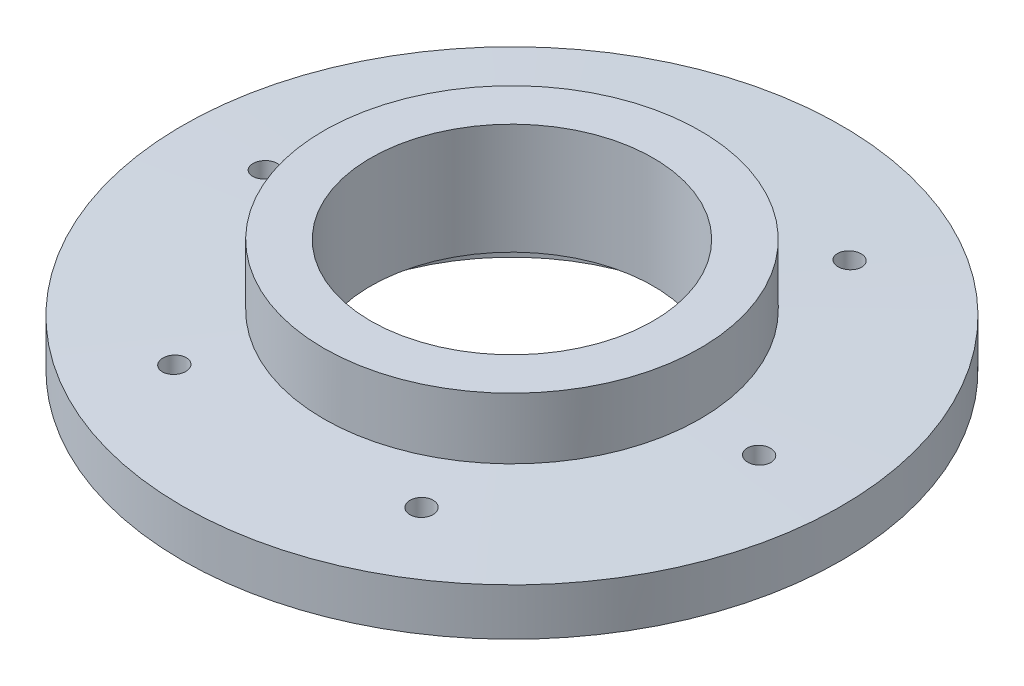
ISO-10303-21;
HEADER;
FILE_DESCRIPTION(('STEP AP214'),'2;1');
FILE_NAME('part.step','',(''),(''),'','','');
FILE_SCHEMA(('AUTOMOTIVE_DESIGN { 1 0 10303 214 1 1 1 1 }'));
ENDSEC;
DATA;
#1=APPLICATION_CONTEXT('core data for automotive mechanical design processes');
#2=APPLICATION_PROTOCOL_DEFINITION('international standard','automotive_design',2000,#1);
#3=PRODUCT_CONTEXT('',#1,'mechanical');
#4=PRODUCT('Part','Part','',(#3));
#5=PRODUCT_RELATED_PRODUCT_CATEGORY('part','',(#4));
#6=PRODUCT_DEFINITION_FORMATION('','',#4);
#7=PRODUCT_DEFINITION_CONTEXT('part definition',#1,'design');
#8=PRODUCT_DEFINITION('design','',#6,#7);
#9=PRODUCT_DEFINITION_SHAPE('','',#8);
#10=(LENGTH_UNIT() NAMED_UNIT(*) SI_UNIT(.MILLI.,.METRE.));
#11=(NAMED_UNIT(*) PLANE_ANGLE_UNIT() SI_UNIT($,.RADIAN.));
#12=(NAMED_UNIT(*) SI_UNIT($,.STERADIAN.) SOLID_ANGLE_UNIT());
#13=UNCERTAINTY_MEASURE_WITH_UNIT(LENGTH_MEASURE(1.E-05),#10,'distance_accuracy_value','');
#14=(GEOMETRIC_REPRESENTATION_CONTEXT(3) GLOBAL_UNCERTAINTY_ASSIGNED_CONTEXT((#13)) GLOBAL_UNIT_ASSIGNED_CONTEXT((#10,
#11,#12)) REPRESENTATION_CONTEXT('',''));
#15=CARTESIAN_POINT('',(0.,0.,0.));
#16=DIRECTION('',(0.,0.,1.));
#17=DIRECTION('',(1.,0.,0.));
#18=AXIS2_PLACEMENT_3D('',#15,#16,#17);
#19=CARTESIAN_POINT('',(0.,6.30952461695,6.));
#20=DIRECTION('',(0.,1.,0.));
#21=DIRECTION('',(0.,0.,1.));
#22=AXIS2_PLACEMENT_3D('',#19,#20,#21);
#23=PLANE('',#22);
#24=CARTESIAN_POINT('',(0.,6.30952461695,0.));
#25=DIRECTION('',(0.,1.,0.));
#26=DIRECTION('',(0.,0.,1.));
#27=AXIS2_PLACEMENT_3D('',#24,#25,#26);
#28=CIRCLE('',#27,6.);
#29=CARTESIAN_POINT('',(0.,6.30952461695,6.));
#30=VERTEX_POINT('',#29);
#31=EDGE_CURVE('E17',#30,#30,#28,.F.);
#32=ORIENTED_EDGE('',*,*,#31,.T.);
#33=EDGE_LOOP('',(#32));
#34=FACE_BOUND('',#33,.T.);
#35=CARTESIAN_POINT('',(0.,6.30952461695,0.));
#36=DIRECTION('',(0.,1.,0.));
#37=DIRECTION('',(0.,0.,1.));
#38=AXIS2_PLACEMENT_3D('',#35,#36,#37);
#39=CIRCLE('',#38,8.);
#40=CARTESIAN_POINT('',(0.,6.30952461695,8.));
#41=VERTEX_POINT('',#40);
#42=EDGE_CURVE('E183',#41,#41,#39,.F.);
#43=ORIENTED_EDGE('',*,*,#42,.F.);
#44=EDGE_LOOP('',(#43));
#45=FACE_BOUND('',#44,.T.);
#46=ADVANCED_FACE('F14',(#34,#45),#23,.T.);
#47=CARTESIAN_POINT('',(0.,3.1547623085,0.));
#48=DIRECTION('',(0.,1.,0.));
#49=DIRECTION('',(0.,0.,1.));
#50=AXIS2_PLACEMENT_3D('',#47,#48,#49);
#51=CYLINDRICAL_SURFACE('',#50,6.);
#52=ORIENTED_EDGE('',*,*,#31,.F.);
#53=EDGE_LOOP('',(#52));
#54=FACE_BOUND('',#53,.T.);
#55=CARTESIAN_POINT('',(0.,1.6,0.));
#56=DIRECTION('',(0.,1.,0.));
#57=DIRECTION('',(0.,0.,1.));
#58=AXIS2_PLACEMENT_3D('',#55,#56,#57);
#59=CIRCLE('',#58,6.);
#60=CARTESIAN_POINT('',(0.,1.6,6.));
#61=VERTEX_POINT('',#60);
#62=EDGE_CURVE('E157',#61,#61,#59,.F.);
#63=ORIENTED_EDGE('',*,*,#62,.T.);
#64=EDGE_LOOP('',(#63));
#65=FACE_BOUND('',#64,.T.);
#66=ADVANCED_FACE('F169',(#54,#65),#51,.F.);
#67=CARTESIAN_POINT('',(0.,3.1547623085,0.));
#68=DIRECTION('',(0.,1.,0.));
#69=DIRECTION('',(0.,0.,1.));
#70=AXIS2_PLACEMENT_3D('',#67,#68,#69);
#71=CYLINDRICAL_SURFACE('',#70,8.);
#72=CARTESIAN_POINT('',(0.,3.70952461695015,0.));
#73=DIRECTION('',(0.,-1.,0.));
#74=DIRECTION('',(0.479425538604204,0.,0.877582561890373));
#75=AXIS2_PLACEMENT_3D('',#72,#73,#74);
#76=CIRCLE('',#75,7.99999999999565);
#77=CARTESIAN_POINT('',(3.83540430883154,3.70952461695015,7.02066049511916));
#78=VERTEX_POINT('',#77);
#79=EDGE_CURVE('E91',#78,#78,#76,.T.);
#80=ORIENTED_EDGE('',*,*,#79,.F.);
#81=EDGE_LOOP('',(#80));
#82=FACE_BOUND('',#81,.T.);
#83=ORIENTED_EDGE('',*,*,#42,.T.);
#84=EDGE_LOOP('',(#83));
#85=FACE_BOUND('',#84,.T.);
#86=ADVANCED_FACE('F166',(#82,#85),#71,.T.);
#87=CARTESIAN_POINT('',(0.,1.6,8.));
#88=DIRECTION('',(0.,1.,0.));
#89=DIRECTION('',(0.,0.,1.));
#90=AXIS2_PLACEMENT_3D('',#87,#88,#89);
#91=PLANE('',#90);
#92=ORIENTED_EDGE('',*,*,#62,.F.);
#93=EDGE_LOOP('',(#92));
#94=FACE_BOUND('',#93,.T.);
#95=CARTESIAN_POINT('',(0.,1.6,0.));
#96=DIRECTION('',(0.,1.,0.));
#97=DIRECTION('',(0.,0.,1.));
#98=AXIS2_PLACEMENT_3D('',#95,#96,#97);
#99=CIRCLE('',#98,8.);
#100=CARTESIAN_POINT('',(0.,1.6,8.));
#101=VERTEX_POINT('',#100);
#102=EDGE_CURVE('E73',#101,#101,#99,.F.);
#103=ORIENTED_EDGE('',*,*,#102,.T.);
#104=EDGE_LOOP('',(#103));
#105=FACE_BOUND('',#104,.T.);
#106=ADVANCED_FACE('F80',(#94,#105),#91,.F.);
#107=CARTESIAN_POINT('',(-5.25,3.,-9.09326673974));
#108=DIRECTION('',(0.,1.,0.));
#109=DIRECTION('',(0.,0.,1.));
#110=AXIS2_PLACEMENT_3D('',#107,#108,#109);
#111=CYLINDRICAL_SURFACE('',#110,0.5);
#112=CARTESIAN_POINT('',(-4.82435396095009,3.63749073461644,-8.83092069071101));
#113=CARTESIAN_POINT('',(-4.83908105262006,3.6379762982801,-8.80703071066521));
#114=CARTESIAN_POINT('',(-4.85584036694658,3.63838755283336,-8.78435381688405));
#115=CARTESIAN_POINT('',(-4.89294339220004,3.6390464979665,-8.74212348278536));
#116=CARTESIAN_POINT('',(-4.9132896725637,3.63929407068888,-8.72257230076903));
#117=CARTESIAN_POINT('',(-4.94532113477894,3.63953139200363,-8.69660058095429));
#118=CARTESIAN_POINT('',(-4.95585512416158,3.63958823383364,-8.68872823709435));
#119=CARTESIAN_POINT('',(-4.977504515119,3.63966408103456,-8.67384001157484));
#120=CARTESIAN_POINT('',(-4.98861964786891,3.63968310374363,-8.66682373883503));
#121=CARTESIAN_POINT('',(-5.02429937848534,3.63968302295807,-8.64622638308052));
#122=CARTESIAN_POINT('',(-5.04980791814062,3.63959612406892,-8.63423469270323));
#123=CARTESIAN_POINT('',(-5.10250744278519,3.63925093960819,-8.61468724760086));
#124=CARTESIAN_POINT('',(-5.1297013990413,3.63899234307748,-8.60713958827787));
#125=CARTESIAN_POINT('',(-5.18495209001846,3.6383122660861,-8.59672066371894));
#126=CARTESIAN_POINT('',(-5.21300818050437,3.63789090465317,-8.59384598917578));
#127=CARTESIAN_POINT('',(-5.26919047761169,3.636899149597,-8.5928459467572));
#128=CARTESIAN_POINT('',(-5.29731665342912,3.63632881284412,-8.59471876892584));
#129=CARTESIAN_POINT('',(-5.3528667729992,3.63505698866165,-8.60315656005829));
#130=CARTESIAN_POINT('',(-5.38029038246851,3.63435544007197,-8.60972372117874));
#131=CARTESIAN_POINT('',(-5.43364586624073,3.63284338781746,-8.62736569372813));
#132=CARTESIAN_POINT('',(-5.45957764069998,3.63203287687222,-8.63844080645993));
#133=CARTESIAN_POINT('',(-5.50922814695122,3.63032739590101,-8.66479140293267));
#134=CARTESIAN_POINT('',(-5.53294554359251,3.62943237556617,-8.68006939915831));
#135=CARTESIAN_POINT('',(-5.57747760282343,3.62758527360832,-8.71438859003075));
#136=CARTESIAN_POINT('',(-5.59829227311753,3.62663319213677,-8.73342977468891));
#137=CARTESIAN_POINT('',(-5.63643993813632,3.62469944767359,-8.77474644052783));
#138=CARTESIAN_POINT('',(-5.65377101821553,3.62371776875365,-8.79702368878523));
#139=CARTESIAN_POINT('',(-5.68444563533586,3.62175354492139,-8.84417242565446));
#140=CARTESIAN_POINT('',(-5.69778916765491,3.62077100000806,-8.86904391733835));
#141=CARTESIAN_POINT('',(-5.72011231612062,3.61883239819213,-8.92068121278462));
#142=CARTESIAN_POINT('',(-5.7290909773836,3.61787634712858,-8.94744742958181));
#143=CARTESIAN_POINT('',(-5.74242448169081,3.61601717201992,-9.00210986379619));
#144=CARTESIAN_POINT('',(-5.74677927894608,3.61511404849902,-9.03000609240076));
#145=CARTESIAN_POINT('',(-5.7507399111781,3.61338510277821,-9.08613232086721));
#146=CARTESIAN_POINT('',(-5.75034638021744,3.61255927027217,-9.11436227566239));
#147=CARTESIAN_POINT('',(-5.74482190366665,3.61100658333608,-9.17035514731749));
#148=CARTESIAN_POINT('',(-5.73969137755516,3.61027972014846,-9.19811810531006));
#149=CARTESIAN_POINT('',(-5.72484320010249,3.60894414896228,-9.25237190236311));
#150=CARTESIAN_POINT('',(-5.71512860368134,3.6083353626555,-9.27886357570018));
#151=CARTESIAN_POINT('',(-5.69138124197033,3.60725060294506,-9.3298545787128));
#152=CARTESIAN_POINT('',(-5.67734641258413,3.60677469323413,-9.35435294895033));
#153=CARTESIAN_POINT('',(-5.64535752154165,3.60596795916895,-9.40065061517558));
#154=CARTESIAN_POINT('',(-5.62740228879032,3.60563717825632,-9.42244910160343));
#155=CARTESIAN_POINT('',(-5.58811361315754,3.60512977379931,-9.46268083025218));
#156=CARTESIAN_POINT('',(-5.5667876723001,3.60495281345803,-9.48112135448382));
#157=CARTESIAN_POINT('',(-5.52990672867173,3.60479302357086,-9.50794875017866));
#158=CARTESIAN_POINT('',(-5.51518840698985,3.60476226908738,-9.51751186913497));
#159=CARTESIAN_POINT('',(-5.47568619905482,3.6047623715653,-9.54031468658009));
#160=CARTESIAN_POINT('',(-5.45016775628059,3.60484134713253,-9.5523112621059));
#161=CARTESIAN_POINT('',(-5.39745675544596,3.60515585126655,-9.57185604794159));
#162=CARTESIAN_POINT('',(-5.37026266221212,3.60539152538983,-9.57940011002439));
#163=CARTESIAN_POINT('',(-5.32586705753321,3.60589097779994,-9.58777292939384));
#164=CARTESIAN_POINT('',(-5.30893037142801,3.60610746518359,-9.59007505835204));
#165=CARTESIAN_POINT('',(-5.27491919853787,3.60659371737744,-9.59293684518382));
#166=CARTESIAN_POINT('',(-5.25784477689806,3.606863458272,-9.59349728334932));
#167=CARTESIAN_POINT('',(-5.21269737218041,3.6076448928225,-9.59266242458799));
#168=CARTESIAN_POINT('',(-5.18463924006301,3.60820037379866,-9.5897711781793));
#169=CARTESIAN_POINT('',(-5.12938205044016,3.60943619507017,-9.57931607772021));
#170=CARTESIAN_POINT('',(-5.10218422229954,3.61011670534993,-9.57174582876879));
#171=CARTESIAN_POINT('',(-5.04946138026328,3.61158435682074,-9.55215055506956));
#172=CARTESIAN_POINT('',(-5.02393542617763,3.61237143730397,-9.54012805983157));
#173=CARTESIAN_POINT('',(-4.97527383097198,3.61403169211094,-9.5119738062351));
#174=CARTESIAN_POINT('',(-4.95213753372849,3.61490484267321,-9.49584318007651));
#175=CARTESIAN_POINT('',(-4.90889020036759,3.61671470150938,-9.45992007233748));
#176=CARTESIAN_POINT('',(-4.88878073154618,3.61765144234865,-9.44012570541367));
#177=CARTESIAN_POINT('',(-4.85217048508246,3.61956269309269,-9.397441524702));
#178=CARTESIAN_POINT('',(-4.83566991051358,3.62053720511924,-9.37455153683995));
#179=CARTESIAN_POINT('',(-4.80673999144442,3.62249732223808,-9.32631570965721));
#180=CARTESIAN_POINT('',(-4.79431244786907,3.62348293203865,-9.30096879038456));
#181=CARTESIAN_POINT('',(-4.77389250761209,3.62543666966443,-9.24854953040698));
#182=CARTESIAN_POINT('',(-4.76589967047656,3.62640479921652,-9.22147736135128));
#183=CARTESIAN_POINT('',(-4.75457507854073,3.62829531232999,-9.16637745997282));
#184=CARTESIAN_POINT('',(-4.75124271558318,3.62921770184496,-9.1383498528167));
#185=CARTESIAN_POINT('',(-4.74933310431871,3.63098981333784,-9.08211455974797));
#186=CARTESIAN_POINT('',(-4.75075840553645,3.63183949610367,-9.05390678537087));
#187=CARTESIAN_POINT('',(-4.75832952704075,3.63344002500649,-8.99811544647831));
#188=CARTESIAN_POINT('',(-4.76447833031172,3.63419080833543,-8.97053228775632));
#189=CARTESIAN_POINT('',(-4.78131897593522,3.63556807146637,-8.916840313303));
#190=CARTESIAN_POINT('',(-4.7919998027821,3.63619484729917,-8.89072809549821));
#191=CARTESIAN_POINT('',(-4.81083538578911,3.6370131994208,-8.85386562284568));
#192=CARTESIAN_POINT('',(-4.81736589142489,3.6372603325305,-8.84225659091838));
#193=CARTESIAN_POINT('',(-4.82435396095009,3.63749073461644,-8.83092069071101));
#194=B_SPLINE_CURVE_WITH_KNOTS('',3,(#112,#113,#114,#115,#116,#117,#118,#119,#120,#121,#122,
#123,#124,#125,#126,#127,#128,#129,#130,#131,#132,#133,#134,#135,#136,#137,#138,#139,#140,#141,
#142,#143,#144,#145,#146,#147,#148,#149,#150,#151,#152,#153,#154,#155,#156,#157,#158,#159,#160,
#161,#162,#163,#164,#165,#166,#167,#168,#169,#170,#171,#172,#173,#174,#175,#176,#177,#178,#179,
#180,#181,#182,#183,#184,#185,#186,#187,#188,#189,#190,#191,#192,#193),.UNSPECIFIED.,.T.,.F.,(4,
2,2,2,2,2,2,2,2,2,2,2,2,2,2,2,2,2,2,2,2,2,2,2,2,2,2,2,2,2,2,2,2,2,2,2,2,2,2,2,4),(0.,
0.0841692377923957,0.168399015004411,0.207815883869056,0.247214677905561,0.33133915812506,
0.415616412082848,0.499832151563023,0.584015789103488,0.668238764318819,0.75246736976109,
0.836746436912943,0.921025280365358,1.00535031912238,1.08967545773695,1.17401903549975,
1.25836344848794,1.34269659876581,1.42702228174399,1.51129184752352,1.59560173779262,
1.67993684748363,1.76408683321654,1.8166655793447,1.90083432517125,1.98508136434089,
2.03628004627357,2.08745578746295,2.1716655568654,2.25599067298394,2.34026795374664,
2.42452203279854,2.50881958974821,2.5931218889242,2.67746141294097,2.76179255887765,
2.84611269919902,2.93047803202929,3.01489668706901,3.09911131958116,3.13904999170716),.UNSPECIFIED.);
#195=CARTESIAN_POINT('',(-4.82435396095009,3.63749073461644,-8.83092069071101));
#196=VERTEX_POINT('',#195);
#197=EDGE_CURVE('E85',#196,#196,#194,.T.);
#198=ORIENTED_EDGE('',*,*,#197,.F.);
#199=EDGE_LOOP('',(#198));
#200=FACE_BOUND('',#199,.T.);
#201=CARTESIAN_POINT('',(-5.00000000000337,0.499999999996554,-8.66025403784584));
#202=CARTESIAN_POINT('',(-4.97627938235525,0.500000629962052,-8.67395174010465));
#203=CARTESIAN_POINT('',(-4.95366440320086,0.50059326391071,-8.68961462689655));
#204=CARTESIAN_POINT('',(-4.9113293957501,0.502945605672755,-8.72441181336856));
#205=CARTESIAN_POINT('',(-4.89161150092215,0.504706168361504,-8.74354864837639));
#206=CARTESIAN_POINT('',(-4.864486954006,0.508186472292,-8.77456146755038));
#207=CARTESIAN_POINT('',(-4.85579336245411,0.509500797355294,-8.78538202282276));
#208=CARTESIAN_POINT('',(-4.83935340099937,0.512398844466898,-8.8076775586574));
#209=CARTESIAN_POINT('',(-4.83160657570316,0.513982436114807,-8.81915222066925));
#210=CARTESIAN_POINT('',(-4.80952294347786,0.519197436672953,-8.8549862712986));
#211=CARTESIAN_POINT('',(-4.79675856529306,0.523239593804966,-8.88028046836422));
#212=CARTESIAN_POINT('',(-4.77569538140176,0.532256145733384,-8.93254413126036));
#213=CARTESIAN_POINT('',(-4.76740502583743,0.537232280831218,-8.95951666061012));
#214=CARTESIAN_POINT('',(-4.75548716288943,0.547933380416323,-9.01427206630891));
#215=CARTESIAN_POINT('',(-4.75185062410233,0.553656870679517,-9.0420532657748));
#216=CARTESIAN_POINT('',(-4.74924436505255,0.565677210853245,-9.09769582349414));
#217=CARTESIAN_POINT('',(-4.75027317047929,0.571973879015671,-9.12555715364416));
#218=CARTESIAN_POINT('',(-4.75698863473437,0.585108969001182,-9.18127296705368));
#219=CARTESIAN_POINT('',(-4.76278253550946,0.591956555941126,-9.20911237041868));
#220=CARTESIAN_POINT('',(-4.77897163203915,0.605864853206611,-9.26336677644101));
#221=CARTESIAN_POINT('',(-4.7893677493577,0.612925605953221,-9.28978149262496));
#222=CARTESIAN_POINT('',(-4.81472539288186,0.627210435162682,-9.34099429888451));
#223=CARTESIAN_POINT('',(-4.82977605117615,0.634434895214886,-9.36574820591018));
#224=CARTESIAN_POINT('',(-4.86394745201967,0.648700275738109,-9.41232412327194));
#225=CARTESIAN_POINT('',(-4.88306788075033,0.655741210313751,-9.43414635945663));
#226=CARTESIAN_POINT('',(-4.92489213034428,0.669454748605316,-9.47424628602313));
#227=CARTESIAN_POINT('',(-4.94760104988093,0.676126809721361,-9.49251884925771));
#228=CARTESIAN_POINT('',(-4.99597517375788,0.688907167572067,-9.52491328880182));
#229=CARTESIAN_POINT('',(-5.02164201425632,0.695015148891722,-9.53903285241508));
#230=CARTESIAN_POINT('',(-5.07475629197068,0.706392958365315,-9.5624355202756));
#231=CARTESIAN_POINT('',(-5.1021691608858,0.711674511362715,-9.57179156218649));
#232=CARTESIAN_POINT('',(-5.15829330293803,0.72134866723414,-9.58562903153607));
#233=CARTESIAN_POINT('',(-5.18700054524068,0.725743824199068,-9.59012463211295));
#234=CARTESIAN_POINT('',(-5.2241774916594,0.730742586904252,-9.5926691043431));
#235=CARTESIAN_POINT('',(-5.23247180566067,0.731813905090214,-9.59302908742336));
#236=CARTESIAN_POINT('',(-5.26807679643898,0.736224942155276,-9.59368321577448));
#237=CARTESIAN_POINT('',(-5.29551418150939,0.739151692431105,-9.59194563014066));
#238=CARTESIAN_POINT('',(-5.34984658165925,0.74400042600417,-9.5839665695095));
#239=CARTESIAN_POINT('',(-5.37674078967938,0.745921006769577,-9.57771883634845));
#240=CARTESIAN_POINT('',(-5.41982031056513,0.748203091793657,-9.56387861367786));
#241=CARTESIAN_POINT('',(-5.43640725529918,0.748876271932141,-9.5575582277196));
#242=CARTESIAN_POINT('',(-5.46881788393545,0.749774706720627,-9.543192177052));
#243=CARTESIAN_POINT('',(-5.48464196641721,0.750000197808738,-9.53514742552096));
#244=CARTESIAN_POINT('',(-5.52382423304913,0.749999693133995,-9.51252293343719));
#245=CARTESIAN_POINT('',(-5.54652696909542,0.749456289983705,-9.49678540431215));
#246=CARTESIAN_POINT('',(-5.58902475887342,0.747296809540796,-9.46180636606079));
#247=CARTESIAN_POINT('',(-5.60881608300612,0.745679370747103,-9.44256043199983));
#248=CARTESIAN_POINT('',(-5.64490562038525,0.741420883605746,-9.4011667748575));
#249=CARTESIAN_POINT('',(-5.66120750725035,0.738780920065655,-9.37902214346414));
#250=CARTESIAN_POINT('',(-5.68991974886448,0.732553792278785,-9.33247075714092));
#251=CARTESIAN_POINT('',(-5.70233091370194,0.728966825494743,-9.30806447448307));
#252=CARTESIAN_POINT('',(-5.72310004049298,0.720897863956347,-9.25738541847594));
#253=CARTESIAN_POINT('',(-5.731409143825,0.716405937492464,-9.23109422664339));
#254=CARTESIAN_POINT('',(-5.74359237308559,0.706675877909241,-9.17763745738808));
#255=CARTESIAN_POINT('',(-5.74746584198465,0.701437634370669,-9.15047175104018));
#256=CARTESIAN_POINT('',(-5.75077893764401,0.690207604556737,-9.09528888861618));
#257=CARTESIAN_POINT('',(-5.75010084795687,0.684199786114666,-9.06726793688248));
#258=CARTESIAN_POINT('',(-5.74411183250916,0.67170185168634,-9.01183581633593));
#259=CARTESIAN_POINT('',(-5.73880025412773,0.665211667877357,-8.98442473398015));
#260=CARTESIAN_POINT('',(-5.72353037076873,0.651740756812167,-8.93022586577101));
#261=CARTESIAN_POINT('',(-5.71345297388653,0.644751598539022,-8.90347369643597));
#262=CARTESIAN_POINT('',(-5.6889179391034,0.630630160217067,-8.85209953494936));
#263=CARTESIAN_POINT('',(-5.67445981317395,0.623497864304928,-8.82747778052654));
#264=CARTESIAN_POINT('',(-5.64129661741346,0.609169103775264,-8.78065994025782));
#265=CARTESIAN_POINT('',(-5.6225266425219,0.601973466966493,-8.75850952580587));
#266=CARTESIAN_POINT('',(-5.58139116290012,0.587843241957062,-8.71774251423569));
#267=CARTESIAN_POINT('',(-5.55902553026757,0.580908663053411,-8.69912604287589));
#268=CARTESIAN_POINT('',(-5.51135915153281,0.567525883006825,-8.66602974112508));
#269=CARTESIAN_POINT('',(-5.48606460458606,0.561076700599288,-8.65154139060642));
#270=CARTESIAN_POINT('',(-5.43320894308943,0.548859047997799,-8.6271321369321));
#271=CARTESIAN_POINT('',(-5.40564824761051,0.543090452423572,-8.61721039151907));
#272=CARTESIAN_POINT('',(-5.34966757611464,0.53255017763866,-8.60246517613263));
#273=CARTESIAN_POINT('',(-5.32127888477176,0.527759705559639,-8.59753651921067));
#274=CARTESIAN_POINT('',(-5.26390936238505,0.519195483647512,-8.59263208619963));
#275=CARTESIAN_POINT('',(-5.2349283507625,0.515422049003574,-8.5926578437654));
#276=CARTESIAN_POINT('',(-5.17817149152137,0.509140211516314,-8.59765823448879));
#277=CARTESIAN_POINT('',(-5.15038600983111,0.50659643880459,-8.6024804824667));
#278=CARTESIAN_POINT('',(-5.09599488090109,0.502708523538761,-8.61674882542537));
#279=CARTESIAN_POINT('',(-5.06938649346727,0.501361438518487,-8.62618349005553));
#280=CARTESIAN_POINT('',(-5.02882278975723,0.500211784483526,-8.64454478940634));
#281=CARTESIAN_POINT('',(-5.01421292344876,0.499999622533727,-8.65204664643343));
#282=CARTESIAN_POINT('',(-5.00000000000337,0.499999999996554,-8.66025403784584));
#283=B_SPLINE_CURVE_WITH_KNOTS('',3,(#201,#202,#203,#204,#205,#206,#207,#208,#209,#210,#211,
#212,#213,#214,#215,#216,#217,#218,#219,#220,#221,#222,#223,#224,#225,#226,#227,#228,#229,#230,
#231,#232,#233,#234,#235,#236,#237,#238,#239,#240,#241,#242,#243,#244,#245,#246,#247,#248,#249,
#250,#251,#252,#253,#254,#255,#256,#257,#258,#259,#260,#261,#262,#263,#264,#265,#266,#267,#268,
#269,#270,#271,#272,#273,#274,#275,#276,#277,#278,#279,#280,#281,#282),.UNSPECIFIED.,.T.,.F.,(4,
2,2,2,2,2,2,2,2,2,2,2,2,2,2,2,2,2,2,2,2,2,2,2,2,2,2,2,2,2,2,2,2,2,2,2,2,2,2,2,4),(0.,
0.0821253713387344,0.164310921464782,0.206093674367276,0.247856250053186,0.333257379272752,
0.418819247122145,0.504214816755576,0.589583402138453,0.676927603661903,0.764289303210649,
0.853440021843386,0.942583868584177,1.03185553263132,1.12117681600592,1.20908587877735,
1.29673789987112,1.32184797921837,1.40436010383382,1.48698694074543,1.5401764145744,
1.59333778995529,1.67580466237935,1.75837627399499,1.84086052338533,1.92332758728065,
2.00675452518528,2.09019381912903,2.17579925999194,2.26141676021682,2.3492969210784,
2.43718687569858,2.5264982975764,2.61581289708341,2.70494180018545,2.79405425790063,
2.88124773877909,2.96846821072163,3.05300343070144,3.13733021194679,3.18653810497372),.UNSPECIFIED.);
#284=CARTESIAN_POINT('',(-5.00000000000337,0.499999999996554,-8.66025403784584));
#285=VERTEX_POINT('',#284);
#286=EDGE_CURVE('E67',#285,#285,#283,.T.);
#287=ORIENTED_EDGE('',*,*,#286,.F.);
#288=EDGE_LOOP('',(#287));
#289=FACE_BOUND('',#288,.T.);
#290=ADVANCED_FACE('F75',(#200,#289),#111,.F.);
#291=CARTESIAN_POINT('',(5.25,3.,9.09326673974));
#292=DIRECTION('',(0.,1.,0.));
#293=DIRECTION('',(0.,0.,1.));
#294=AXIS2_PLACEMENT_3D('',#291,#292,#293);
#295=CYLINDRICAL_SURFACE('',#294,0.5);
#296=CARTESIAN_POINT('',(5.50000000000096,3.60476230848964,9.52627944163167));
#297=CARTESIAN_POINT('',(5.4756861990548,3.60476237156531,9.5403146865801));
#298=CARTESIAN_POINT('',(5.45016775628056,3.60484134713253,9.55231126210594));
#299=CARTESIAN_POINT('',(5.39745675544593,3.60515585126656,9.57185604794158));
#300=CARTESIAN_POINT('',(5.3702626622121,3.60539152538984,9.5794001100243));
#301=CARTESIAN_POINT('',(5.32586705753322,3.60589097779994,9.58777292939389));
#302=CARTESIAN_POINT('',(5.30893037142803,3.60610746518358,9.59007505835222));
#303=CARTESIAN_POINT('',(5.27491919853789,3.60659371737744,9.59293684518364));
#304=CARTESIAN_POINT('',(5.25784477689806,3.60686345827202,9.59349728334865));
#305=CARTESIAN_POINT('',(5.21269737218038,3.60764489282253,9.59266242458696));
#306=CARTESIAN_POINT('',(5.18463924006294,3.60820037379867,9.58977117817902));
#307=CARTESIAN_POINT('',(5.12938205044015,3.60943619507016,9.57931607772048));
#308=CARTESIAN_POINT('',(5.1021842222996,3.61011670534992,9.57174582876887));
#309=CARTESIAN_POINT('',(5.04946138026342,3.61158435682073,9.55215055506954));
#310=CARTESIAN_POINT('',(5.02393542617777,3.61237143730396,9.54012805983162));
#311=CARTESIAN_POINT('',(4.97527383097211,3.61403169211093,9.51197380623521));
#312=CARTESIAN_POINT('',(4.9521375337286,3.61490484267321,9.4958431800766));
#313=CARTESIAN_POINT('',(4.90889020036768,3.61671470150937,9.45992007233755));
#314=CARTESIAN_POINT('',(4.88878073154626,3.61765144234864,9.44012570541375));
#315=CARTESIAN_POINT('',(4.85217048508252,3.61956269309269,9.39744152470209));
#316=CARTESIAN_POINT('',(4.83566991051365,3.62053720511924,9.37455153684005));
#317=CARTESIAN_POINT('',(4.80673999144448,3.62249732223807,9.32631570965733));
#318=CARTESIAN_POINT('',(4.79431244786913,3.62348293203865,9.30096879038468));
#319=CARTESIAN_POINT('',(4.77389250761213,3.62543666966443,9.24854953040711));
#320=CARTESIAN_POINT('',(4.76589967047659,3.62640479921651,9.2214773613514));
#321=CARTESIAN_POINT('',(4.75457507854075,3.62829531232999,9.16637745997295));
#322=CARTESIAN_POINT('',(4.75124271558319,3.62921770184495,9.13834985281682));
#323=CARTESIAN_POINT('',(4.74933310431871,3.63098981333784,9.0821145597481));
#324=CARTESIAN_POINT('',(4.75075840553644,3.63183949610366,9.05390678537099));
#325=CARTESIAN_POINT('',(4.75832952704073,3.63344002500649,8.99811544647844));
#326=CARTESIAN_POINT('',(4.76447833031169,3.63419080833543,8.97053228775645));
#327=CARTESIAN_POINT('',(4.78131897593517,3.63556807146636,8.91684031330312));
#328=CARTESIAN_POINT('',(4.79199980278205,3.63619484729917,8.89072809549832));
#329=CARTESIAN_POINT('',(4.81083538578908,3.6370131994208,8.85386562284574));
#330=CARTESIAN_POINT('',(4.81736589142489,3.6372603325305,8.84225659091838));
#331=CARTESIAN_POINT('',(4.8390810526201,3.6379762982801,8.80703071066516));
#332=CARTESIAN_POINT('',(4.85584036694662,3.63838755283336,8.784353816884));
#333=CARTESIAN_POINT('',(4.89294339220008,3.6390464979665,8.74212348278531));
#334=CARTESIAN_POINT('',(4.91328967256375,3.63929407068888,8.72257230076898));
#335=CARTESIAN_POINT('',(4.94532113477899,3.63953139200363,8.69660058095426));
#336=CARTESIAN_POINT('',(4.95585512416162,3.63958823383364,8.68872823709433));
#337=CARTESIAN_POINT('',(4.97750451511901,3.63966408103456,8.67384001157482));
#338=CARTESIAN_POINT('',(4.98861964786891,3.63968310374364,8.66682373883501));
#339=CARTESIAN_POINT('',(5.02429937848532,3.63968302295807,8.6462263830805));
#340=CARTESIAN_POINT('',(5.04980791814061,3.63959612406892,8.63423469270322));
#341=CARTESIAN_POINT('',(5.10250744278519,3.63925093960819,8.61468724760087));
#342=CARTESIAN_POINT('',(5.1297013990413,3.63899234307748,8.60713958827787));
#343=CARTESIAN_POINT('',(5.18495209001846,3.6383122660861,8.59672066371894));
#344=CARTESIAN_POINT('',(5.21300818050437,3.63789090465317,8.59384598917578));
#345=CARTESIAN_POINT('',(5.2691904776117,3.636899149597,8.5928459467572));
#346=CARTESIAN_POINT('',(5.29731665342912,3.63632881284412,8.59471876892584));
#347=CARTESIAN_POINT('',(5.3528667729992,3.63505698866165,8.60315656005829));
#348=CARTESIAN_POINT('',(5.38029038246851,3.63435544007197,8.60972372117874));
#349=CARTESIAN_POINT('',(5.43364586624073,3.63284338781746,8.62736569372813));
#350=CARTESIAN_POINT('',(5.45957764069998,3.63203287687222,8.63844080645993));
#351=CARTESIAN_POINT('',(5.50922814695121,3.63032739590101,8.66479140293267));
#352=CARTESIAN_POINT('',(5.53294554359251,3.62943237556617,8.68006939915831));
#353=CARTESIAN_POINT('',(5.57747760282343,3.62758527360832,8.71438859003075));
#354=CARTESIAN_POINT('',(5.59829227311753,3.62663319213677,8.73342977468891));
#355=CARTESIAN_POINT('',(5.63643993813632,3.6246994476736,8.77474644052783));
#356=CARTESIAN_POINT('',(5.65377101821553,3.62371776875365,8.79702368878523));
#357=CARTESIAN_POINT('',(5.68444563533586,3.62175354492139,8.84417242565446));
#358=CARTESIAN_POINT('',(5.69778916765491,3.62077100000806,8.86904391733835));
#359=CARTESIAN_POINT('',(5.72011231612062,3.61883239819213,8.92068121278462));
#360=CARTESIAN_POINT('',(5.7290909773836,3.61787634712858,8.94744742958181));
#361=CARTESIAN_POINT('',(5.74242448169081,3.61601717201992,9.00210986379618));
#362=CARTESIAN_POINT('',(5.74677927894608,3.61511404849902,9.03000609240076));
#363=CARTESIAN_POINT('',(5.7507399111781,3.61338510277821,9.0861323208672));
#364=CARTESIAN_POINT('',(5.75034638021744,3.61255927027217,9.11436227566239));
#365=CARTESIAN_POINT('',(5.74482190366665,3.61100658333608,9.17035514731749));
#366=CARTESIAN_POINT('',(5.73969137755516,3.61027972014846,9.19811810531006));
#367=CARTESIAN_POINT('',(5.72484320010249,3.60894414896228,9.25237190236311));
#368=CARTESIAN_POINT('',(5.71512860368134,3.6083353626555,9.27886357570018));
#369=CARTESIAN_POINT('',(5.69138124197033,3.60725060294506,9.3298545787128));
#370=CARTESIAN_POINT('',(5.67734641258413,3.60677469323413,9.35435294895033));
#371=CARTESIAN_POINT('',(5.64535752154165,3.60596795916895,9.40065061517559));
#372=CARTESIAN_POINT('',(5.62740228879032,3.60563717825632,9.42244910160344));
#373=CARTESIAN_POINT('',(5.58811361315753,3.60512977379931,9.46268083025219));
#374=CARTESIAN_POINT('',(5.5667876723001,3.60495281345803,9.48112135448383));
#375=CARTESIAN_POINT('',(5.52990672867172,3.60479302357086,9.50794875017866));
#376=CARTESIAN_POINT('',(5.51518840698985,3.60476226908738,9.51751186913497));
#377=CARTESIAN_POINT('',(5.50000000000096,3.60476230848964,9.52627944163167));
#378=B_SPLINE_CURVE_WITH_KNOTS('',3,(#296,#297,#298,#299,#300,#301,#302,#303,#304,#305,#306,
#307,#308,#309,#310,#311,#312,#313,#314,#315,#316,#317,#318,#319,#320,#321,#322,#323,#324,#325,
#326,#327,#328,#329,#330,#331,#332,#333,#334,#335,#336,#337,#338,#339,#340,#341,#342,#343,#344,
#345,#346,#347,#348,#349,#350,#351,#352,#353,#354,#355,#356,#357,#358,#359,#360,#361,#362,#363,
#364,#365,#366,#367,#368,#369,#370,#371,#372,#373,#374,#375,#376,#377),.UNSPECIFIED.,.T.,.F.,(4,
2,2,2,2,2,2,2,2,2,2,2,2,2,2,2,2,2,2,2,2,2,2,2,2,2,2,2,2,2,2,2,2,2,2,2,2,2,2,2,4),(0.,
0.0841687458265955,0.16841578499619,0.219614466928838,0.270790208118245,0.354999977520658,
0.439325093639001,0.523602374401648,0.607856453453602,0.692154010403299,0.776456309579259,
0.860795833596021,0.945126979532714,1.02944711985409,1.11381245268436,1.19823110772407,
1.28244574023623,1.32238441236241,1.40655365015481,1.49078342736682,1.53020029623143,
1.5695990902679,1.6537235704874,1.7380008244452,1.82221656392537,1.90640020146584,
1.99062317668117,2.07485178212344,2.15913084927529,2.24340969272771,2.32773473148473,
2.4120598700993,2.4964034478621,2.58074786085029,2.66508101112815,2.74940669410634,
2.83367625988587,2.91798615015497,3.00232125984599,3.08647124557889,3.13904999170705),.UNSPECIFIED.);
#379=CARTESIAN_POINT('',(5.50000000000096,3.60476230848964,9.52627944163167));
#380=VERTEX_POINT('',#379);
#381=EDGE_CURVE('E92',#380,#380,#378,.T.);
#382=ORIENTED_EDGE('',*,*,#381,.F.);
#383=EDGE_LOOP('',(#382));
#384=FACE_BOUND('',#383,.T.);
#385=CARTESIAN_POINT('',(5.00000000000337,0.499999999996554,8.66025403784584));
#386=CARTESIAN_POINT('',(4.97627938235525,0.500000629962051,8.67395174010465));
#387=CARTESIAN_POINT('',(4.95366440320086,0.500593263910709,8.68961462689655));
#388=CARTESIAN_POINT('',(4.9113293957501,0.502945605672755,8.72441181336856));
#389=CARTESIAN_POINT('',(4.89161150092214,0.504706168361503,8.74354864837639));
#390=CARTESIAN_POINT('',(4.86448695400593,0.50818647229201,8.77456146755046));
#391=CARTESIAN_POINT('',(4.85579336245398,0.509500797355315,8.78538202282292));
#392=CARTESIAN_POINT('',(4.83935340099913,0.512398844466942,8.80767755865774));
#393=CARTESIAN_POINT('',(4.83160657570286,0.513982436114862,8.81915222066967));
#394=CARTESIAN_POINT('',(4.80952294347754,0.519197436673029,8.85498627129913));
#395=CARTESIAN_POINT('',(4.79675856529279,0.523239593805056,8.88028046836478));
#396=CARTESIAN_POINT('',(4.77569538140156,0.532256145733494,8.93254413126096));
#397=CARTESIAN_POINT('',(4.76740502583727,0.537232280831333,8.95951666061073));
#398=CARTESIAN_POINT('',(4.75548716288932,0.54793338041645,9.01427206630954));
#399=CARTESIAN_POINT('',(4.75185062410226,0.55365687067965,9.04205326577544));
#400=CARTESIAN_POINT('',(4.74924436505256,0.565677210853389,9.09769582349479));
#401=CARTESIAN_POINT('',(4.75027317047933,0.571973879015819,9.12555715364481));
#402=CARTESIAN_POINT('',(4.75698863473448,0.585108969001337,9.18127296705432));
#403=CARTESIAN_POINT('',(4.76278253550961,0.591956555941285,9.20911237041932));
#404=CARTESIAN_POINT('',(4.77897163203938,0.605864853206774,9.26336677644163));
#405=CARTESIAN_POINT('',(4.78936774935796,0.612925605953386,9.28978149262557));
#406=CARTESIAN_POINT('',(4.81472539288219,0.627210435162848,9.34099429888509));
#407=CARTESIAN_POINT('',(4.82977605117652,0.634434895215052,9.36574820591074));
#408=CARTESIAN_POINT('',(4.8639474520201,0.648700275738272,9.41232412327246));
#409=CARTESIAN_POINT('',(4.88306788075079,0.655741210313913,9.43414635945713));
#410=CARTESIAN_POINT('',(4.92489213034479,0.669454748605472,9.47424628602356));
#411=CARTESIAN_POINT('',(4.94760104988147,0.676126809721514,9.49251884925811));
#412=CARTESIAN_POINT('',(4.99597517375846,0.68890716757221,9.52491328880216));
#413=CARTESIAN_POINT('',(5.02164201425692,0.69501514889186,9.53903285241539));
#414=CARTESIAN_POINT('',(5.07475629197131,0.706392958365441,9.56243552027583));
#415=CARTESIAN_POINT('',(5.10216916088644,0.711674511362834,9.57179156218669));
#416=CARTESIAN_POINT('',(5.15829330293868,0.721348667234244,9.58562903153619));
#417=CARTESIAN_POINT('',(5.18700054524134,0.725743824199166,9.59012463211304));
#418=CARTESIAN_POINT('',(5.22417749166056,0.730742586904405,9.59266910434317));
#419=CARTESIAN_POINT('',(5.23247180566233,0.731813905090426,9.59302908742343));
#420=CARTESIAN_POINT('',(5.26807679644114,0.736224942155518,9.5936832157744));
#421=CARTESIAN_POINT('',(5.29551418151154,0.739151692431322,9.59194563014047));
#422=CARTESIAN_POINT('',(5.34984658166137,0.744000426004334,9.58396656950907));
#423=CARTESIAN_POINT('',(5.37674078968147,0.745921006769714,9.57771883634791));
#424=CARTESIAN_POINT('',(5.41982031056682,0.748203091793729,9.56387861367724));
#425=CARTESIAN_POINT('',(5.4364072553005,0.748876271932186,9.55755822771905));
#426=CARTESIAN_POINT('',(5.46881788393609,0.749774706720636,9.54319217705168));
#427=CARTESIAN_POINT('',(5.48464196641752,0.750000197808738,9.53514742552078));
#428=CARTESIAN_POINT('',(5.52382423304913,0.749999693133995,9.51252293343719));
#429=CARTESIAN_POINT('',(5.54652696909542,0.749456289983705,9.49678540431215));
#430=CARTESIAN_POINT('',(5.58902475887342,0.747296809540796,9.46180636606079));
#431=CARTESIAN_POINT('',(5.60881608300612,0.745679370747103,9.44256043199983));
#432=CARTESIAN_POINT('',(5.64490562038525,0.741420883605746,9.4011667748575));
#433=CARTESIAN_POINT('',(5.66120750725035,0.738780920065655,9.37902214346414));
#434=CARTESIAN_POINT('',(5.68991974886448,0.732553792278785,9.33247075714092));
#435=CARTESIAN_POINT('',(5.70233091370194,0.728966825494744,9.30806447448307));
#436=CARTESIAN_POINT('',(5.72310004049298,0.720897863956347,9.25738541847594));
#437=CARTESIAN_POINT('',(5.731409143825,0.716405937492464,9.23109422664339));
#438=CARTESIAN_POINT('',(5.74359237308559,0.706675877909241,9.17763745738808));
#439=CARTESIAN_POINT('',(5.74746584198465,0.701437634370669,9.15047175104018));
#440=CARTESIAN_POINT('',(5.75077893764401,0.690207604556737,9.09528888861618));
#441=CARTESIAN_POINT('',(5.75010084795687,0.684199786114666,9.06726793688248));
#442=CARTESIAN_POINT('',(5.74411183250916,0.67170185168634,9.01183581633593));
#443=CARTESIAN_POINT('',(5.73880025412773,0.665211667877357,8.98442473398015));
#444=CARTESIAN_POINT('',(5.72353037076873,0.651740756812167,8.93022586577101));
#445=CARTESIAN_POINT('',(5.71345297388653,0.644751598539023,8.90347369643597));
#446=CARTESIAN_POINT('',(5.6889179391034,0.630630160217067,8.85209953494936));
#447=CARTESIAN_POINT('',(5.67445981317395,0.623497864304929,8.82747778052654));
#448=CARTESIAN_POINT('',(5.64129661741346,0.609169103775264,8.78065994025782));
#449=CARTESIAN_POINT('',(5.6225266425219,0.601973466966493,8.75850952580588));
#450=CARTESIAN_POINT('',(5.58139116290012,0.587843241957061,8.71774251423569));
#451=CARTESIAN_POINT('',(5.55902553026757,0.580908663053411,8.69912604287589));
#452=CARTESIAN_POINT('',(5.51135915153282,0.567525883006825,8.66602974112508));
#453=CARTESIAN_POINT('',(5.48606460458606,0.561076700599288,8.65154139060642));
#454=CARTESIAN_POINT('',(5.43320894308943,0.548859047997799,8.6271321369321));
#455=CARTESIAN_POINT('',(5.40564824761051,0.543090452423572,8.61721039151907));
#456=CARTESIAN_POINT('',(5.34966757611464,0.53255017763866,8.60246517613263));
#457=CARTESIAN_POINT('',(5.32127888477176,0.527759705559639,8.59753651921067));
#458=CARTESIAN_POINT('',(5.26390936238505,0.519195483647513,8.59263208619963));
#459=CARTESIAN_POINT('',(5.2349283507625,0.515422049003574,8.5926578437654));
#460=CARTESIAN_POINT('',(5.17817149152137,0.509140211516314,8.59765823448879));
#461=CARTESIAN_POINT('',(5.15038600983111,0.50659643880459,8.6024804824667));
#462=CARTESIAN_POINT('',(5.09599488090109,0.502708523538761,8.61674882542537));
#463=CARTESIAN_POINT('',(5.06938649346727,0.501361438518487,8.62618349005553));
#464=CARTESIAN_POINT('',(5.02882278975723,0.500211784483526,8.64454478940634));
#465=CARTESIAN_POINT('',(5.01421292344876,0.499999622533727,8.65204664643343));
#466=CARTESIAN_POINT('',(5.00000000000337,0.499999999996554,8.66025403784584));
#467=B_SPLINE_CURVE_WITH_KNOTS('',3,(#385,#386,#387,#388,#389,#390,#391,#392,#393,#394,#395,
#396,#397,#398,#399,#400,#401,#402,#403,#404,#405,#406,#407,#408,#409,#410,#411,#412,#413,#414,
#415,#416,#417,#418,#419,#420,#421,#422,#423,#424,#425,#426,#427,#428,#429,#430,#431,#432,#433,
#434,#435,#436,#437,#438,#439,#440,#441,#442,#443,#444,#445,#446,#447,#448,#449,#450,#451,#452,
#453,#454,#455,#456,#457,#458,#459,#460,#461,#462,#463,#464,#465,#466),.UNSPECIFIED.,.T.,.F.,(4,
2,2,2,2,2,2,2,2,2,2,2,2,2,2,2,2,2,2,2,2,2,2,2,2,2,2,2,2,2,2,2,2,2,2,2,2,2,2,2,4),(0.,
0.0821253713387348,0.164310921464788,0.206093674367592,0.247856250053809,0.333257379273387,
0.418819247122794,0.504214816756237,0.589583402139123,0.67692760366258,0.764289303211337,
0.853440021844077,0.942583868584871,1.03185553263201,1.12117681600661,1.20908587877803,
1.29673789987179,1.32184797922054,1.40436010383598,1.48698694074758,1.54017641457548,
1.5933377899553,1.67580466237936,1.75837627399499,1.84086052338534,1.92332758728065,
2.00675452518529,2.09019381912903,2.17579925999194,2.26141676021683,2.3492969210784,
2.43718687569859,2.5264982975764,2.61581289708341,2.70494180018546,2.79405425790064,
2.88124773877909,2.96846821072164,3.05300343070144,3.13733021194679,3.18653810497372),.UNSPECIFIED.);
#468=CARTESIAN_POINT('',(5.00000000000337,0.499999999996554,8.66025403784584));
#469=VERTEX_POINT('',#468);
#470=EDGE_CURVE('E62',#469,#469,#467,.T.);
#471=ORIENTED_EDGE('',*,*,#470,.F.);
#472=EDGE_LOOP('',(#471));
#473=FACE_BOUND('',#472,.T.);
#474=ADVANCED_FACE('F79',(#384,#473),#295,.F.);
#475=CARTESIAN_POINT('',(10.5,3.,0.));
#476=DIRECTION('',(0.,1.,0.));
#477=DIRECTION('',(0.,0.,1.));
#478=AXIS2_PLACEMENT_3D('',#475,#476,#477);
#479=CYLINDRICAL_SURFACE('',#478,0.5);
#480=CARTESIAN_POINT('',(11.,3.60476230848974,0.));
#481=CARTESIAN_POINT('',(10.9999976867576,3.60476238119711,0.0280573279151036));
#482=CARTESIAN_POINT('',(10.9976296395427,3.60484129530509,0.056140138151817));
#483=CARTESIAN_POINT('',(10.9882090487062,3.60515551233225,0.111556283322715));
#484=CARTESIAN_POINT('',(10.9811464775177,3.60539115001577,0.138887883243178));
#485=CARTESIAN_POINT('',(10.962539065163,3.6060129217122,0.191955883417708));
#486=CARTESIAN_POINT('',(10.950998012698,3.60639892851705,0.217693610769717));
#487=CARTESIAN_POINT('',(10.9237677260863,3.60731158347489,0.266852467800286));
#488=CARTESIAN_POINT('',(10.9080804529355,3.6078381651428,0.2902746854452));
#489=CARTESIAN_POINT('',(10.8729935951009,3.60901900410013,0.334163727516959));
#490=CARTESIAN_POINT('',(10.8535924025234,3.60967331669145,0.354629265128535));
#491=CARTESIAN_POINT('',(10.8116315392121,3.61109279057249,0.392014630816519));
#492=CARTESIAN_POINT('',(10.7890715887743,3.61185796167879,0.408934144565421));
#493=CARTESIAN_POINT('',(10.741423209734,3.61347962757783,0.438754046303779));
#494=CARTESIAN_POINT('',(10.7163335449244,3.61433616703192,0.451652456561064));
#495=CARTESIAN_POINT('',(10.6643474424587,3.61611757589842,0.47305397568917));
#496=CARTESIAN_POINT('',(10.6374510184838,3.61704244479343,0.481557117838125));
#497=CARTESIAN_POINT('',(10.5825992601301,3.61893604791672,0.493931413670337));
#498=CARTESIAN_POINT('',(10.5546433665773,3.61990480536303,0.497800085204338));
#499=CARTESIAN_POINT('',(10.4984794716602,3.62185894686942,0.500787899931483));
#500=CARTESIAN_POINT('',(10.4702714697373,3.62284433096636,0.49990703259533));
#501=CARTESIAN_POINT('',(10.4143951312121,3.62480413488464,0.493419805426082));
#502=CARTESIAN_POINT('',(10.3867269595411,3.62577855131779,0.487812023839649));
#503=CARTESIAN_POINT('',(10.3327242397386,3.62768785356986,0.47202773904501));
#504=CARTESIAN_POINT('',(10.3063897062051,3.62862273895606,0.461851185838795));
#505=CARTESIAN_POINT('',(10.2558034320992,3.63042513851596,0.43721786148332));
#506=CARTESIAN_POINT('',(10.2315516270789,3.63129265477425,0.422761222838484));
#507=CARTESIAN_POINT('',(10.1858214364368,3.63293385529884,0.389978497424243));
#508=CARTESIAN_POINT('',(10.1643428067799,3.63370754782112,0.371652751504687));
#509=CARTESIAN_POINT('',(10.124780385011,3.63513664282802,0.331663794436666));
#510=CARTESIAN_POINT('',(10.1066944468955,3.63579212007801,0.310002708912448));
#511=CARTESIAN_POINT('',(10.0744077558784,3.6369648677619,0.263936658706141));
#512=CARTESIAN_POINT('',(10.0602088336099,3.63748207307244,0.239530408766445));
#513=CARTESIAN_POINT('',(10.0361099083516,3.63836126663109,0.188675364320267));
#514=CARTESIAN_POINT('',(10.0262107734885,3.63872322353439,0.162226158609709));
#515=CARTESIAN_POINT('',(10.0110156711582,3.63927928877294,0.108083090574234));
#516=CARTESIAN_POINT('',(10.0057098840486,3.63947375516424,0.0803920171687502));
#517=CARTESIAN_POINT('',(10.0009204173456,3.63964932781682,0.0350464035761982));
#518=CARTESIAN_POINT('',(9.99999855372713,3.63968313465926,0.0175281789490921));
#519=CARTESIAN_POINT('',(10.0000023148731,3.63968298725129,-0.0280552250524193));
#520=CARTESIAN_POINT('',(10.0023700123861,3.63959614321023,-0.056135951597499));
#521=CARTESIAN_POINT('',(10.0117891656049,3.63925103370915,-0.11154792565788));
#522=CARTESIAN_POINT('',(10.0188506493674,3.63899240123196,-0.138877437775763));
#523=CARTESIAN_POINT('',(10.0374550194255,3.6383122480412,-0.191941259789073));
#524=CARTESIAN_POINT('',(10.0489941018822,3.63789086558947,-0.217676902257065));
#525=CARTESIAN_POINT('',(10.0762195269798,3.63689909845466,-0.266831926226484));
#526=CARTESIAN_POINT('',(10.0919039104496,3.63632878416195,-0.290252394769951));
#527=CARTESIAN_POINT('',(10.1269853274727,3.63505699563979,-0.334140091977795));
#528=CARTESIAN_POINT('',(10.1463842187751,3.63435545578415,-0.354605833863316));
#529=CARTESIAN_POINT('',(10.1883402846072,3.63284340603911,-0.391992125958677));
#530=CARTESIAN_POINT('',(10.2108977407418,3.63203288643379,-0.408912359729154));
#531=CARTESIAN_POINT('',(10.2585436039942,3.6303273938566,-0.438735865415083));
#532=CARTESIAN_POINT('',(10.2836334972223,3.629432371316,-0.451636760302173));
#533=CARTESIAN_POINT('',(10.3356208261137,3.62758526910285,-0.473043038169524));
#534=CARTESIAN_POINT('',(10.3625182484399,3.6266331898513,-0.481548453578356));
#535=CARTESIAN_POINT('',(10.4173732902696,3.6246994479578,-0.493926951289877));
#536=CARTESIAN_POINT('',(10.445331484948,3.62371776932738,-0.497797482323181));
#537=CARTESIAN_POINT('',(10.5015007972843,3.62175354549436,-0.500788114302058));
#538=CARTESIAN_POINT('',(10.5297119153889,3.62077100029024,-0.4999082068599));
#539=CARTESIAN_POINT('',(10.5855927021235,3.61883239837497,-0.49342197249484));
#540=CARTESIAN_POINT('',(10.613262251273,3.61787634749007,-0.487814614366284));
#541=CARTESIAN_POINT('',(10.6672680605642,3.61601717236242,-0.472030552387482));
#542=CARTESIAN_POINT('',(10.6936043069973,3.61511404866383,-0.461853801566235));
#543=CARTESIAN_POINT('',(10.7441913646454,3.61338510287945,-0.437220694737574));
#544=CARTESIAN_POINT('',(10.7684424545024,3.61255927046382,-0.422764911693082));
#545=CARTESIAN_POINT('',(10.8141714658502,3.61100658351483,-0.389984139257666));
#546=CARTESIAN_POINT('',(10.8356496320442,3.61027972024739,-0.371659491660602));
#547=CARTESIAN_POINT('',(10.8752107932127,3.60894414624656,-0.331673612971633));
#548=CARTESIAN_POINT('',(10.8932960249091,3.60833535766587,-0.310014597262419));
#549=CARTESIAN_POINT('',(10.9255818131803,3.60725059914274,-0.263953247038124));
#550=CARTESIAN_POINT('',(10.9397805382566,3.60677469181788,-0.239549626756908));
#551=CARTESIAN_POINT('',(10.9638806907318,3.60596796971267,-0.188698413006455));
#552=CARTESIAN_POINT('',(10.9737809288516,3.60563719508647,-0.162250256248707));
#553=CARTESIAN_POINT('',(10.9889784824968,3.6051297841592,-0.108109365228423));
#554=CARTESIAN_POINT('',(10.9942856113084,3.6049528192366,-0.0804194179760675));
#555=CARTESIAN_POINT('',(10.9990785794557,3.60479302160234,-0.0350654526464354));
#556=CARTESIAN_POINT('',(11.000001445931,3.60476226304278,-0.0175377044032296));
#557=CARTESIAN_POINT('',(11.,3.60476230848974,0.));
#558=B_SPLINE_CURVE_WITH_KNOTS('',3,(#480,#481,#482,#483,#484,#485,#486,#487,#488,#489,#490,
#491,#492,#493,#494,#495,#496,#497,#498,#499,#500,#501,#502,#503,#504,#505,#506,#507,#508,#509,
#510,#511,#512,#513,#514,#515,#516,#517,#518,#519,#520,#521,#522,#523,#524,#525,#526,#527,#528,
#529,#530,#531,#532,#533,#534,#535,#536,#537,#538,#539,#540,#541,#542,#543,#544,#545,#546,#547,
#548,#549,#550,#551,#552,#553,#554,#555,#556,#557),.UNSPECIFIED.,.T.,.F.,(4,2,2,2,2,2,2,2,2,2,2,
2,2,2,2,2,2,2,2,2,2,2,2,2,2,2,2,2,2,2,2,2,2,2,2,2,2,2,4),(0.,0.0841170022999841,
0.168414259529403,0.252640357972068,0.336826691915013,0.421049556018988,0.50527988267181,
0.589551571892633,0.673822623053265,0.758138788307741,0.842455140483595,0.92679686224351,
1.0111395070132,1.09547954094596,1.17981214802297,1.26409123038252,1.34840993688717,
1.43274565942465,1.51690064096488,1.56945084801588,1.65356157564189,1.7378525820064,
1.82207213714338,1.90625195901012,1.99047399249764,2.07470353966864,2.15898280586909,
2.2432614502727,2.32758646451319,2.41191162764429,2.49625518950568,2.58059961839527,
2.66493275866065,2.74925845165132,2.83352835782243,2.91783790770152,3.00217076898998,
3.08632300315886,3.13890174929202),.UNSPECIFIED.);
#559=CARTESIAN_POINT('',(11.,3.60476230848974,0.));
#560=VERTEX_POINT('',#559);
#561=EDGE_CURVE('E153',#560,#560,#558,.T.);
#562=ORIENTED_EDGE('',*,*,#561,.F.);
#563=EDGE_LOOP('',(#562));
#564=FACE_BOUND('',#563,.T.);
#565=CARTESIAN_POINT('',(10.,0.499999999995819,0.));
#566=CARTESIAN_POINT('',(10.0000025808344,0.500000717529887,0.027396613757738));
#567=CARTESIAN_POINT('',(10.0022615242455,0.500593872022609,0.0548203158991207));
#568=CARTESIAN_POINT('',(10.0112354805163,0.502947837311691,0.108922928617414));
#569=CARTESIAN_POINT('',(10.0179602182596,0.504711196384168,0.135600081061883));
#570=CARTESIAN_POINT('',(10.0356308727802,0.509336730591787,0.187370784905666));
#571=CARTESIAN_POINT('',(10.0465702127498,0.512197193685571,0.212466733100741));
#572=CARTESIAN_POINT('',(10.0723108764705,0.518912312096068,0.260428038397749));
#573=CARTESIAN_POINT('',(10.087110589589,0.522766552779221,0.283294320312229));
#574=CARTESIAN_POINT('',(10.1203649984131,0.531402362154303,0.326545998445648));
#575=CARTESIAN_POINT('',(10.1388704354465,0.536196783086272,0.346889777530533));
#576=CARTESIAN_POINT('',(10.1788465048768,0.54651971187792,0.384198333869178));
#577=CARTESIAN_POINT('',(10.2003177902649,0.55204838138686,0.40116236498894));
#578=CARTESIAN_POINT('',(10.2463225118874,0.563851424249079,0.431780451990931));
#579=CARTESIAN_POINT('',(10.2709297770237,0.570143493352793,0.445316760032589));
#580=CARTESIAN_POINT('',(10.3219659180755,0.583141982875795,0.468064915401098));
#581=CARTESIAN_POINT('',(10.3483950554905,0.589848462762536,0.477276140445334));
#582=CARTESIAN_POINT('',(10.4031063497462,0.603675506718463,0.49135641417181));
#583=CARTESIAN_POINT('',(10.4314194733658,0.610802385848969,0.496099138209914));
#584=CARTESIAN_POINT('',(10.4884316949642,0.625093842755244,0.500683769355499));
#585=CARTESIAN_POINT('',(10.517130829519,0.63225842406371,0.500525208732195));
#586=CARTESIAN_POINT('',(10.5744785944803,0.646517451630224,0.495269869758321));
#587=CARTESIAN_POINT('',(10.6031220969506,0.653609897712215,0.490111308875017));
#588=CARTESIAN_POINT('',(10.6591647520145,0.66743351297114,0.474878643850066));
#589=CARTESIAN_POINT('',(10.6865639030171,0.674164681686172,0.464804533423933));
#590=CARTESIAN_POINT('',(10.7391114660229,0.68702901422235,0.440071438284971));
#591=CARTESIAN_POINT('',(10.7642745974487,0.693166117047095,0.425445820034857));
#592=CARTESIAN_POINT('',(10.8117899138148,0.704719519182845,0.391958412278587));
#593=CARTESIAN_POINT('',(10.8341426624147,0.710135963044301,0.373097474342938));
#594=CARTESIAN_POINT('',(10.8748379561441,0.7199721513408,0.332130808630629));
#595=CARTESIAN_POINT('',(10.8932612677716,0.724412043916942,0.310110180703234));
#596=CARTESIAN_POINT('',(10.9261399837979,0.732320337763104,0.263110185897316));
#597=CARTESIAN_POINT('',(10.9405941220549,0.735788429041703,0.238129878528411));
#598=CARTESIAN_POINT('',(10.9646945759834,0.741563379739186,0.186667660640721));
#599=CARTESIAN_POINT('',(10.9744611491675,0.743899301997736,0.160245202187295));
#600=CARTESIAN_POINT('',(10.9894130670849,0.747473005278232,0.106112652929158));
#601=CARTESIAN_POINT('',(10.9946090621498,0.748713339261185,0.0784057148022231));
#602=CARTESIAN_POINT('',(10.9991487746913,0.749796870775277,0.0337066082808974));
#603=CARTESIAN_POINT('',(11.0000015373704,0.750000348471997,0.0168582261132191));
#604=CARTESIAN_POINT('',(10.9999974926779,0.749999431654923,-0.0274943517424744));
#605=CARTESIAN_POINT('',(10.9977226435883,0.749456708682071,-0.0550148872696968));
#606=CARTESIAN_POINT('',(10.9886833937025,0.747298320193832,-0.109311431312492));
#607=CARTESIAN_POINT('',(10.9819092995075,0.745680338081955,-0.136085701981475));
#608=CARTESIAN_POINT('',(10.9641009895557,0.741420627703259,-0.188050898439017));
#609=CARTESIAN_POINT('',(10.9530727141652,0.738780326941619,-0.213243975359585));
#610=CARTESIAN_POINT('',(10.9271133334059,0.732553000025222,-0.261384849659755));
#611=CARTESIAN_POINT('',(10.9121839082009,0.728966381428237,-0.284333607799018));
#612=CARTESIAN_POINT('',(10.8786813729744,0.720897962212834,-0.327656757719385));
#613=CARTESIAN_POINT('',(10.8600675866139,0.716406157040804,-0.347997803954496));
#614=CARTESIAN_POINT('',(10.8198644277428,0.706676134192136,-0.385277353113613));
#615=CARTESIAN_POINT('',(10.7982744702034,0.701437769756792,-0.402215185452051));
#616=CARTESIAN_POINT('',(10.7521405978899,0.690207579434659,-0.432676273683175));
#617=CARTESIAN_POINT('',(10.7275345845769,0.684199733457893,-0.446099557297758));
#618=CARTESIAN_POINT('',(10.6765344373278,0.67170179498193,-0.46862894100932));
#619=CARTESIAN_POINT('',(10.6501400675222,0.665211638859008,-0.47773447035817));
#620=CARTESIAN_POINT('',(10.5955676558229,0.651740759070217,-0.491609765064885));
#621=CARTESIAN_POINT('',(10.5673609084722,0.644751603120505,-0.496258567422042));
#622=CARTESIAN_POINT('',(10.5106020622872,0.63063016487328,-0.500697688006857));
#623=CARTESIAN_POINT('',(10.4820499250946,0.623497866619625,-0.500487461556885));
#624=CARTESIAN_POINT('',(10.4249228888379,0.609169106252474,-0.495176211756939));
#625=CARTESIAN_POINT('',(10.3963550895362,0.60197347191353,-0.489996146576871));
#626=CARTESIAN_POINT('',(10.3404820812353,0.587843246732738,-0.474755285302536));
#627=CARTESIAN_POINT('',(10.3131769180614,0.580908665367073,-0.464694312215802));
#628=CARTESIAN_POINT('',(10.2606814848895,0.567525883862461,-0.439962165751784));
#629=CARTESIAN_POINT('',(10.2354869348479,0.561076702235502,-0.425300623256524));
#630=CARTESIAN_POINT('',(10.1879200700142,0.548859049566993,-0.391730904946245));
#631=CARTESIAN_POINT('',(10.1655472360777,0.543090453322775,-0.372823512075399));
#632=CARTESIAN_POINT('',(10.1247870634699,0.532550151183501,-0.331715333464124));
#633=CARTESIAN_POINT('',(10.1063242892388,0.527759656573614,-0.309594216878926));
#634=CARTESIAN_POINT('',(10.0733922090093,0.5191954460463,-0.262362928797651));
#635=CARTESIAN_POINT('',(10.0589241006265,0.515422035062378,-0.237251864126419));
#636=CARTESIAN_POINT('',(10.0348765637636,0.50914030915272,-0.185599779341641));
#637=CARTESIAN_POINT('',(10.0251602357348,0.50659659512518,-0.159126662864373));
#638=CARTESIAN_POINT('',(10.0103211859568,0.502708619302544,-0.104888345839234));
#639=CARTESIAN_POINT('',(10.005187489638,0.501361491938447,-0.0771264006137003));
#640=CARTESIAN_POINT('',(10.0008067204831,0.500211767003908,-0.0328160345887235));
#641=CARTESIAN_POINT('',(9.99999845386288,0.499999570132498,-0.0164128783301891));
#642=CARTESIAN_POINT('',(10.,0.499999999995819,0.));
#643=B_SPLINE_CURVE_WITH_KNOTS('',3,(#565,#566,#567,#568,#569,#570,#571,#572,#573,#574,#575,
#576,#577,#578,#579,#580,#581,#582,#583,#584,#585,#586,#587,#588,#589,#590,#591,#592,#593,#594,
#595,#596,#597,#598,#599,#600,#601,#602,#603,#604,#605,#606,#607,#608,#609,#610,#611,#612,#613,
#614,#615,#616,#617,#618,#619,#620,#621,#622,#623,#624,#625,#626,#627,#628,#629,#630,#631,#632,
#633,#634,#635,#636,#637,#638,#639,#640,#641,#642),.UNSPECIFIED.,.T.,.F.,(4,2,2,2,2,2,2,2,2,2,2,
2,2,2,2,2,2,2,2,2,2,2,2,2,2,2,2,2,2,2,2,2,2,2,2,2,2,2,4),(0.,0.0821385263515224,
0.164456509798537,0.246646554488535,0.328802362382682,0.412171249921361,0.49555852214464,
0.581508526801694,0.667470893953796,0.755796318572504,0.844130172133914,0.933569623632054,
1.02300918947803,1.11180794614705,1.20058886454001,1.28731720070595,1.37407317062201,
1.4584655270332,1.54266070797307,1.5932029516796,1.67563310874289,1.75824143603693,
1.84073482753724,1.92319274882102,2.00661765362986,2.09005898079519,2.17566479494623,
2.26128192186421,2.34916205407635,2.4370520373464,2.5263634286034,2.61567805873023,
2.70480695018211,2.79391941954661,2.8811133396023,2.96833337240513,3.05286586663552,
3.13719537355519,3.18640326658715),.UNSPECIFIED.);
#644=CARTESIAN_POINT('',(10.,0.499999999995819,0.));
#645=VERTEX_POINT('',#644);
#646=EDGE_CURVE('E57',#645,#645,#643,.T.);
#647=ORIENTED_EDGE('',*,*,#646,.F.);
#648=EDGE_LOOP('',(#647));
#649=FACE_BOUND('',#648,.T.);
#650=ADVANCED_FACE('F206',(#564,#649),#479,.F.);
#651=CARTESIAN_POINT('',(5.25,3.,-9.09326673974));
#652=DIRECTION('',(0.,1.,0.));
#653=DIRECTION('',(0.,0.,1.));
#654=AXIS2_PLACEMENT_3D('',#651,#652,#653);
#655=CYLINDRICAL_SURFACE('',#654,0.5);
#656=CARTESIAN_POINT('',(5.50000000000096,3.60476230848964,-9.52627944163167));
#657=CARTESIAN_POINT('',(5.52429720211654,3.60476238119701,-9.51224877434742));
#658=CARTESIAN_POINT('',(5.54743360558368,3.60484129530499,-9.49615658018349));
#659=CARTESIAN_POINT('',(5.59071509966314,3.60515551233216,-9.46029003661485));
#660=CARTESIAN_POINT('',(5.61085367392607,3.60539115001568,-9.44050787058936));
#661=CARTESIAN_POINT('',(5.64750820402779,3.60601292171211,-9.39785937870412));
#662=CARTESIAN_POINT('',(5.66402720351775,3.60639892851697,-9.37499567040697));
#663=CARTESIAN_POINT('',(5.69298487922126,3.60731158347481,-9.32683412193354));
#664=CARTESIAN_POINT('',(5.70542547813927,3.60783816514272,-9.30153743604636));
#665=CARTESIAN_POINT('',(5.72589107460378,3.60901900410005,-9.24920680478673));
#666=CARTESIAN_POINT('',(5.73391415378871,3.60967331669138,-9.22217211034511));
#667=CARTESIAN_POINT('',(5.74531039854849,3.61109279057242,-9.16714025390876));
#668=CARTESIAN_POINT('',(5.74868315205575,3.61185796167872,-9.13914300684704));
#669=CARTESIAN_POINT('',(5.75068375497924,3.61347962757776,-9.08296834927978));
#670=CARTESIAN_POINT('',(5.74930927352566,3.61433616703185,-9.05479085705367));
#671=CARTESIAN_POINT('',(5.74185048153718,3.61611757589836,-8.99906881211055));
#672=CARTESIAN_POINT('',(5.73576620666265,3.61704244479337,-8.97152425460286));
#673=CARTESIAN_POINT('',(5.71905678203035,3.61893604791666,-8.91783409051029));
#674=CARTESIAN_POINT('',(5.70842920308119,3.61990480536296,-8.89168924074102));
#675=CARTESIAN_POINT('',(5.68293477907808,3.62185894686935,-8.84155597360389));
#676=CARTESIAN_POINT('',(5.66806792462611,3.62284433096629,-8.81756756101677));
#677=CARTESIAN_POINT('',(5.63451165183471,3.62480413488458,-8.77242084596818));
#678=CARTESIAN_POINT('',(5.61582108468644,3.62577855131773,-8.75126339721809));
#679=CARTESIAN_POINT('',(5.57515013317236,3.6276878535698,-8.71238781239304));
#680=CARTESIAN_POINT('',(5.55316971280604,3.62862273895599,-8.69466971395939));
#681=CARTESIAN_POINT('',(5.5065434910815,3.63042513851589,-8.66317737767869));
#682=CARTESIAN_POINT('',(5.48189777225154,3.63129265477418,-8.64940301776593));
#683=CARTESIAN_POINT('',(5.43064200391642,3.63293385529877,-8.62619087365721));
#684=CARTESIAN_POINT('',(5.40403212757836,3.63370754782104,-8.61675270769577));
#685=CARTESIAN_POINT('',(5.34961946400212,3.63513664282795,-8.60248512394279));
#686=CARTESIAN_POINT('',(5.32181744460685,3.63579212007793,-8.59765278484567));
#687=CARTESIAN_POINT('',(5.26577972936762,3.63696486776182,-8.592724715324));
#688=CARTESIAN_POINT('',(5.23754383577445,3.63748207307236,-8.59263121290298));
#689=CARTESIAN_POINT('',(5.18145261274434,3.63836126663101,-8.59718845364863));
#690=CARTESIAN_POINT('',(5.15359736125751,3.6387232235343,-8.60184015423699));
#691=CARTESIAN_POINT('',(5.09911053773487,3.63927928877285,-8.61575234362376));
#692=CARTESIAN_POINT('',(5.07247647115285,3.63947375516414,-8.62500293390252));
#693=CARTESIAN_POINT('',(5.03081128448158,3.63964932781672,-8.64352794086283));
#694=CARTESIAN_POINT('',(5.01517912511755,3.63968313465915,-8.6514886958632));
#695=CARTESIAN_POINT('',(4.97570461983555,3.6396829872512,-8.67428365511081));
#696=CARTESIAN_POINT('',(4.95256984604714,3.63959614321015,-8.69037450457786));
#697=CARTESIAN_POINT('',(4.90929124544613,3.63925103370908,-8.72623771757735));
#698=CARTESIAN_POINT('',(4.8891539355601,3.6389924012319,-8.74601789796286));
#699=CARTESIAN_POINT('',(4.85250150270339,3.63831224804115,-8.78866166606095));
#700=CARTESIAN_POINT('',(4.83598332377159,3.63789086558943,-8.8115226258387));
#701=CARTESIAN_POINT('',(4.80702653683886,3.63689909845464,-8.85967804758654));
#702=CARTESIAN_POINT('',(4.7945860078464,3.63632878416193,-8.88497135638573));
#703=CARTESIAN_POINT('',(4.77411885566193,3.63505699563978,-8.93729660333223));
#704=CARTESIAN_POINT('',(4.76609444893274,3.63435545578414,-8.96432940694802));
#705=CARTESIAN_POINT('',(4.75469500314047,3.63284340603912,-9.01935757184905));
#706=CARTESIAN_POINT('',(4.75132037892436,3.63203288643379,-9.0473530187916));
#707=CARTESIAN_POINT('',(4.74931539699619,3.63032739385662,-9.10352729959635));
#708=CARTESIAN_POINT('',(4.75068784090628,3.62943237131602,-9.13170623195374));
#709=CARTESIAN_POINT('',(4.75814312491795,3.62758526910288,-9.18743171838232));
#710=CARTESIAN_POINT('',(4.76422593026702,3.62663318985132,-9.21497827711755));
#711=CARTESIAN_POINT('',(4.78093335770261,3.62469944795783,-9.26867338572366));
#712=CARTESIAN_POINT('',(4.79156047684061,3.62371776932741,-9.2948211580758));
#713=CARTESIAN_POINT('',(4.81705516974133,3.62175354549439,-9.34496052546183));
#714=CARTESIAN_POINT('',(4.83192275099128,3.62077100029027,-9.36895211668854));
#715=CARTESIAN_POINT('',(4.86548038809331,3.618832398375,-9.41410318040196));
#716=CARTESIAN_POINT('',(4.8841712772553,3.6178763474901,-9.43526203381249));
#717=CARTESIAN_POINT('',(4.92484358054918,3.61601717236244,-9.47414040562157));
#718=CARTESIAN_POINT('',(4.94682502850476,3.61511404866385,-9.4918598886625));
#719=CARTESIAN_POINT('',(4.99345145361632,3.61338510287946,-9.52335301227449));
#720=CARTESIAN_POINT('',(5.01809607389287,3.61255927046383,-9.5371271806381));
#721=CARTESIAN_POINT('',(5.0693495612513,3.61100658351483,-9.56033927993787));
#722=CARTESIAN_POINT('',(5.09595825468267,3.61027972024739,-9.56977759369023));
#723=CARTESIAN_POINT('',(5.15036762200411,3.60894414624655,-9.58404562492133));
#724=CARTESIAN_POINT('',(5.17816749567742,3.60833535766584,-9.58887838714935));
#725=CARTESIAN_POINT('',(5.23420068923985,3.6072505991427,-9.59380802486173));
#726=CARTESIAN_POINT('',(5.26243420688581,3.60677469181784,-9.59390267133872));
#727=CARTESIAN_POINT('',(5.31852272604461,3.60596796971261,-9.58934840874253));
#728=CARTESIAN_POINT('',(5.34637762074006,3.60563719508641,-9.5846981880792));
#729=CARTESIAN_POINT('',(5.40086378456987,3.60512978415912,-9.57078921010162));
#730=CARTESIAN_POINT('',(5.42749754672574,3.60495281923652,-9.56154034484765));
#731=CARTESIAN_POINT('',(5.46917171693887,3.60479302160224,-9.54301419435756));
#732=CARTESIAN_POINT('',(5.48481262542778,3.60476226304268,-9.53504954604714));
#733=CARTESIAN_POINT('',(5.50000000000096,3.60476230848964,-9.52627944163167));
#734=B_SPLINE_CURVE_WITH_KNOTS('',3,(#656,#657,#658,#659,#660,#661,#662,#663,#664,#665,#666,
#667,#668,#669,#670,#671,#672,#673,#674,#675,#676,#677,#678,#679,#680,#681,#682,#683,#684,#685,
#686,#687,#688,#689,#690,#691,#692,#693,#694,#695,#696,#697,#698,#699,#700,#701,#702,#703,#704,
#705,#706,#707,#708,#709,#710,#711,#712,#713,#714,#715,#716,#717,#718,#719,#720,#721,#722,#723,
#724,#725,#726,#727,#728,#729,#730,#731,#732,#733),.UNSPECIFIED.,.T.,.F.,(4,2,2,2,2,2,2,2,2,2,2,
2,2,2,2,2,2,2,2,2,2,2,2,2,2,2,2,2,2,2,2,2,2,2,2,2,2,2,4),(0.,0.0841170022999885,
0.168414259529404,0.252640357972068,0.336826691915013,0.421049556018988,0.50527988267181,
0.589551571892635,0.673822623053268,0.758138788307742,0.842455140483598,0.926796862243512,
1.0111395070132,1.09547954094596,1.17981214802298,1.26409123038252,1.34840993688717,
1.43274565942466,1.51690064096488,1.56945084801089,1.65356157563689,1.73785258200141,
1.82207213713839,1.90625195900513,1.99047399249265,2.07470353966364,2.1589828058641,
2.2432614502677,2.32758646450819,2.41191162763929,2.49625518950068,2.58059961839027,
2.66493275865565,2.74925845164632,2.83352835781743,2.91783790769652,3.00217076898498,
3.08632300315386,3.13890174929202),.UNSPECIFIED.);
#735=CARTESIAN_POINT('',(5.50000000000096,3.60476230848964,-9.52627944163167));
#736=VERTEX_POINT('',#735);
#737=EDGE_CURVE('E149',#736,#736,#734,.T.);
#738=ORIENTED_EDGE('',*,*,#737,.F.);
#739=EDGE_LOOP('',(#738));
#740=FACE_BOUND('',#739,.T.);
#741=CARTESIAN_POINT('',(5.00000000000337,0.499999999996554,-8.66025403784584));
#742=CARTESIAN_POINT('',(5.02372745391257,0.500000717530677,-8.64655796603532));
#743=CARTESIAN_POINT('',(5.04860654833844,0.500593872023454,-8.63480241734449));
#744=CARTESIAN_POINT('',(5.09994776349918,0.502947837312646,-8.61552278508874));
#745=CARTESIAN_POINT('',(5.12641322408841,0.504711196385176,-8.60800800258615));
#746=CARTESIAN_POINT('',(5.18008329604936,0.509336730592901,-8.59742588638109));
#747=CARTESIAN_POINT('',(5.20728669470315,0.512197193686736,-8.59435165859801));
#748=CARTESIAN_POINT('',(5.26169273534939,0.51891231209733,-8.59266307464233));
#749=CARTESIAN_POINT('',(5.28889537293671,0.522766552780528,-8.59404686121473));
#750=CARTESIAN_POINT('',(5.34297962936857,0.531402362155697,-8.60122018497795));
#751=CARTESIAN_POINT('',(5.36985057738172,0.536196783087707,-8.60707447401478));
#752=CARTESIAN_POINT('',(5.42214876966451,0.546519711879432,-8.6230404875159));
#753=CARTESIAN_POINT('',(5.44757569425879,0.552048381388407,-8.63315315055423));
#754=CARTESIAN_POINT('',(5.49709409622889,0.56385142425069,-8.65768536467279));
#755=CARTESIAN_POINT('',(5.52112051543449,0.570143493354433,-8.6722277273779));
#756=CARTESIAN_POINT('',(5.56633906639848,0.583141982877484,-8.70505224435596));
#757=CARTESIAN_POINT('',(5.58753078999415,0.589848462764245,-8.72333493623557));
#758=CARTESIAN_POINT('',(5.62708031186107,0.603675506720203,-8.76367617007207));
#759=CARTESIAN_POINT('',(5.6453441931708,0.610802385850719,-8.78582469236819));
#760=CARTESIAN_POINT('',(5.6778207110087,0.625093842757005,-8.83290640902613));
#761=CARTESIAN_POINT('',(5.69203296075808,0.632258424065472,-8.85783986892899));
#762=CARTESIAN_POINT('',(5.7161555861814,0.646517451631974,-8.91013215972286));
#763=CARTESIAN_POINT('',(5.72600989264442,0.653609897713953,-8.93751744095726));
#764=CARTESIAN_POINT('',(5.74083934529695,0.667433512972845,-8.99366813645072));
#765=CARTESIAN_POINT('',(5.74581448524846,0.674164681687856,-9.02243355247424));
#766=CARTESIAN_POINT('',(5.75066877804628,0.68702901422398,-9.08030762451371));
#767=CARTESIAN_POINT('',(5.75058418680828,0.693166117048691,-9.10941234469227));
#768=CARTESIAN_POINT('',(5.74534089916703,0.704719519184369,-9.16730551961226));
#769=CARTESIAN_POINT('',(5.74018322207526,0.710135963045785,-9.19609403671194));
#770=CARTESIAN_POINT('',(5.72505269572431,0.719972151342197,-9.25182052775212));
#771=CARTESIAN_POINT('',(5.71519392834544,0.724412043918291,-9.27878589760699));
#772=CARTESIAN_POINT('',(5.69093009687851,0.732320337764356,-9.33075969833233));
#773=CARTESIAN_POINT('',(5.676523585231,0.735788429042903,-9.35576750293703));
#774=CARTESIAN_POINT('',(5.64400622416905,0.741563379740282,-9.4023702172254));
#775=CARTESIAN_POINT('',(5.62600699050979,0.74389930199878,-9.42403954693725));
#776=CARTESIAN_POINT('',(5.58660278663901,0.747473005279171,-9.46405456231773));
#777=CARTESIAN_POINT('',(5.56520587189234,0.748713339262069,-9.4824078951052));
#778=CARTESIAN_POINT('',(5.52876516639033,0.749796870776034,-9.50868895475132));
#779=CARTESIAN_POINT('',(5.51460042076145,0.750000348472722,-9.51785165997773));
#780=CARTESIAN_POINT('',(5.47618793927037,0.749999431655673,-9.54002444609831));
#781=CARTESIAN_POINT('',(5.45121703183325,0.749456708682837,-9.55181463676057));
#782=CARTESIAN_POINT('',(5.39967522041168,0.74729832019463,-9.5711346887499));
#783=CARTESIAN_POINT('',(5.37310097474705,0.745680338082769,-9.57865528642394));
#784=CARTESIAN_POINT('',(5.31919363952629,0.741420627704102,-9.58921543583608));
#785=CARTESIAN_POINT('',(5.29186165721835,0.738780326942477,-9.59226120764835));
#786=CARTESIAN_POINT('',(5.23719074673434,0.732553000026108,-9.59385016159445));
#787=CARTESIAN_POINT('',(5.20985182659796,0.728966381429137,-9.59239527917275));
#788=CARTESIAN_POINT('',(5.15558161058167,0.720897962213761,-9.58504280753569));
#789=CARTESIAN_POINT('',(5.12865885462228,0.716406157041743,-9.57909331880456));
#790=CARTESIAN_POINT('',(5.07627223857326,0.706676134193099,-9.56291613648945));
#791=CARTESIAN_POINT('',(5.05080866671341,0.701437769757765,-9.55268760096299));
#792=CARTESIAN_POINT('',(5.00136165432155,0.690207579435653,-9.52796503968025));
#793=CARTESIAN_POINT('',(4.97743374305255,0.684199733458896,-9.51336724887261));
#794=CARTESIAN_POINT('',(4.93242265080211,0.671701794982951,-9.48046451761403));
#795=CARTESIAN_POINT('',(4.91133984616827,0.665211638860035,-9.46215908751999));
#796=CARTESIAN_POINT('',(4.87203728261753,0.651740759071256,-9.4218356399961));
#797=CARTESIAN_POINT('',(4.85390792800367,0.644751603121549,-9.39973228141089));
#798=CARTESIAN_POINT('',(4.82168411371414,0.630630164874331,-9.35279723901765));
#799=CARTESIAN_POINT('',(4.807590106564,0.623497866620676,-9.32796524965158));
#800=CARTESIAN_POINT('',(4.78362626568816,0.609169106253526,-9.2758361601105));
#801=CARTESIAN_POINT('',(4.77382843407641,0.60197347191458,-9.24850568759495));
#802=CARTESIAN_POINT('',(4.75909090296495,0.587843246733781,-9.19249781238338));
#803=CARTESIAN_POINT('',(4.75415137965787,0.580908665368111,-9.163820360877));
#804=CARTESIAN_POINT('',(4.74932233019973,0.567525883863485,-9.10599190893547));
#805=CARTESIAN_POINT('',(4.74942232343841,0.561076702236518,-9.07684201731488));
#806=CARTESIAN_POINT('',(4.75471111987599,0.548859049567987,-9.01886304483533));
#807=CARTESIAN_POINT('',(4.75989898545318,0.543090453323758,-8.99003390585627));
#808=CARTESIAN_POINT('',(4.77511962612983,0.532550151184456,-8.93418047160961));
#809=CARTESIAN_POINT('',(4.78504568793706,0.527759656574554,-8.9071306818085));
#810=CARTESIAN_POINT('',(4.80948314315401,0.519195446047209,-8.85499501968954));
#811=CARTESIAN_POINT('',(4.82399590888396,0.51542203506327,-8.82990973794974));
#812=CARTESIAN_POINT('',(4.8567041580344,0.509140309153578,-8.78325791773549));
#813=CARTESIAN_POINT('',(4.87477238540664,0.506596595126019,-8.76160677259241));
#814=CARTESIAN_POINT('',(4.91432462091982,0.502708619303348,-8.72163662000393));
#815=CARTESIAN_POINT('',(4.93580032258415,0.501361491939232,-8.7033097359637));
#816=CARTESIAN_POINT('',(4.97198384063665,0.500211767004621,-8.67736069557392));
#817=CARTESIAN_POINT('',(4.98578525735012,0.4999995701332,-8.66845913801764));
#818=CARTESIAN_POINT('',(5.00000000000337,0.499999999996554,-8.66025403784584));
#819=B_SPLINE_CURVE_WITH_KNOTS('',3,(#741,#742,#743,#744,#745,#746,#747,#748,#749,#750,#751,
#752,#753,#754,#755,#756,#757,#758,#759,#760,#761,#762,#763,#764,#765,#766,#767,#768,#769,#770,
#771,#772,#773,#774,#775,#776,#777,#778,#779,#780,#781,#782,#783,#784,#785,#786,#787,#788,#789,
#790,#791,#792,#793,#794,#795,#796,#797,#798,#799,#800,#801,#802,#803,#804,#805,#806,#807,#808,
#809,#810,#811,#812,#813,#814,#815,#816,#817,#818),.UNSPECIFIED.,.T.,.F.,(4,2,2,2,2,2,2,2,2,2,2,
2,2,2,2,2,2,2,2,2,2,2,2,2,2,2,2,2,2,2,2,2,2,2,2,2,2,2,4),(0.,0.0821385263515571,0.1644565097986,
0.246646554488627,0.328802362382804,0.412171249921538,0.49555852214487,0.581508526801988,
0.667470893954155,0.755796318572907,0.84413017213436,0.933569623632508,1.02300918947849,
1.11180794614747,1.2005888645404,1.28731720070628,1.37407317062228,1.45846552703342,
1.54266070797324,1.5932029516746,1.67563310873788,1.75824143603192,1.84073482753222,
1.92319274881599,2.00661765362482,2.09005898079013,2.17566479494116,2.26128192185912,
2.34916205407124,2.43705203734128,2.52636342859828,2.6156780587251,2.70480695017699,
2.7939194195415,2.88111333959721,2.96833337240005,3.05286586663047,3.13719537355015,
3.18640326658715),.UNSPECIFIED.);
#820=CARTESIAN_POINT('',(5.00000000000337,0.499999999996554,-8.66025403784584));
#821=VERTEX_POINT('',#820);
#822=EDGE_CURVE('E50',#821,#821,#819,.T.);
#823=ORIENTED_EDGE('',*,*,#822,.F.);
#824=EDGE_LOOP('',(#823));
#825=FACE_BOUND('',#824,.T.);
#826=ADVANCED_FACE('F101',(#740,#825),#655,.F.);
#827=CARTESIAN_POINT('',(0.,3.50000000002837,0.));
#828=DIRECTION('',(0.,-1.,0.));
#829=DIRECTION('',(1.,0.,0.));
#830=AXIS2_PLACEMENT_3D('',#827,#828,#829);
#831=CONICAL_SURFACE('',#830,14.0000000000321,1.53588974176);
#832=CARTESIAN_POINT('',(0.,3.5,0.));
#833=DIRECTION('',(0.,1.,0.));
#834=DIRECTION('',(0.,0.,1.));
#835=AXIS2_PLACEMENT_3D('',#832,#833,#834);
#836=CIRCLE('',#835,14.);
#837=CARTESIAN_POINT('',(0.,3.5,14.));
#838=VERTEX_POINT('',#837);
#839=EDGE_CURVE('E33',#838,#838,#836,.F.);
#840=ORIENTED_EDGE('',*,*,#839,.F.);
#841=EDGE_LOOP('',(#840));
#842=FACE_BOUND('',#841,.T.);
#843=ORIENTED_EDGE('',*,*,#381,.T.);
#844=EDGE_LOOP('',(#843));
#845=FACE_BOUND('',#844,.T.);
#846=ORIENTED_EDGE('',*,*,#79,.T.);
#847=EDGE_LOOP('',(#846));
#848=FACE_BOUND('',#847,.T.);
#849=CARTESIAN_POINT('',(-5.50000000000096,3.60476230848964,9.52627944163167));
#850=CARTESIAN_POINT('',(-5.52429720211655,3.60476238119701,9.51224877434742));
#851=CARTESIAN_POINT('',(-5.54743360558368,3.60484129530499,9.49615658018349));
#852=CARTESIAN_POINT('',(-5.59071509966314,3.60515551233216,9.46029003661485));
#853=CARTESIAN_POINT('',(-5.61085367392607,3.60539115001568,9.44050787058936));
#854=CARTESIAN_POINT('',(-5.64750820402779,3.60601292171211,9.39785937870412));
#855=CARTESIAN_POINT('',(-5.66402720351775,3.60639892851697,9.37499567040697));
#856=CARTESIAN_POINT('',(-5.69298487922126,3.60731158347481,9.32683412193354));
#857=CARTESIAN_POINT('',(-5.70542547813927,3.60783816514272,9.30153743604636));
#858=CARTESIAN_POINT('',(-5.72589107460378,3.60901900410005,9.24920680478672));
#859=CARTESIAN_POINT('',(-5.73391415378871,3.60967331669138,9.22217211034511));
#860=CARTESIAN_POINT('',(-5.74531039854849,3.61109279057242,9.16714025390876));
#861=CARTESIAN_POINT('',(-5.74868315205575,3.61185796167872,9.13914300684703));
#862=CARTESIAN_POINT('',(-5.75068375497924,3.61347962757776,9.08296834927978));
#863=CARTESIAN_POINT('',(-5.74930927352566,3.61433616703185,9.05479085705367));
#864=CARTESIAN_POINT('',(-5.74185048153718,3.61611757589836,8.99906881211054));
#865=CARTESIAN_POINT('',(-5.73576620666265,3.61704244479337,8.97152425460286));
#866=CARTESIAN_POINT('',(-5.71905678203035,3.61893604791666,8.91783409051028));
#867=CARTESIAN_POINT('',(-5.70842920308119,3.61990480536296,8.89168924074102));
#868=CARTESIAN_POINT('',(-5.68293477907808,3.62185894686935,8.84155597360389));
#869=CARTESIAN_POINT('',(-5.6680679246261,3.62284433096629,8.81756756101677));
#870=CARTESIAN_POINT('',(-5.63451165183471,3.62480413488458,8.77242084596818));
#871=CARTESIAN_POINT('',(-5.61582108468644,3.62577855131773,8.75126339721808));
#872=CARTESIAN_POINT('',(-5.57515013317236,3.6276878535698,8.71238781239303));
#873=CARTESIAN_POINT('',(-5.55316971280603,3.62862273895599,8.69466971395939));
#874=CARTESIAN_POINT('',(-5.5065434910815,3.63042513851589,8.66317737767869));
#875=CARTESIAN_POINT('',(-5.48189777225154,3.63129265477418,8.64940301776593));
#876=CARTESIAN_POINT('',(-5.43064200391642,3.63293385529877,8.62619087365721));
#877=CARTESIAN_POINT('',(-5.40403212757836,3.63370754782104,8.61675270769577));
#878=CARTESIAN_POINT('',(-5.34961946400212,3.63513664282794,8.60248512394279));
#879=CARTESIAN_POINT('',(-5.32181744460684,3.63579212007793,8.59765278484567));
#880=CARTESIAN_POINT('',(-5.26577972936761,3.63696486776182,8.592724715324));
#881=CARTESIAN_POINT('',(-5.23754383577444,3.63748207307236,8.59263121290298));
#882=CARTESIAN_POINT('',(-5.18145261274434,3.63836126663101,8.59718845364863));
#883=CARTESIAN_POINT('',(-5.15359736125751,3.6387232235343,8.60184015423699));
#884=CARTESIAN_POINT('',(-5.09911053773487,3.63927928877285,8.61575234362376));
#885=CARTESIAN_POINT('',(-5.07247647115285,3.63947375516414,8.62500293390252));
#886=CARTESIAN_POINT('',(-5.03081128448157,3.63964932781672,8.64352794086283));
#887=CARTESIAN_POINT('',(-5.01517912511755,3.63968313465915,8.6514886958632));
#888=CARTESIAN_POINT('',(-4.97570461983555,3.6396829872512,8.67428365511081));
#889=CARTESIAN_POINT('',(-4.95256984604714,3.63959614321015,8.69037450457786));
#890=CARTESIAN_POINT('',(-4.90929124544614,3.63925103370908,8.72623771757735));
#891=CARTESIAN_POINT('',(-4.88915393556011,3.6389924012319,8.74601789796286));
#892=CARTESIAN_POINT('',(-4.8525015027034,3.63831224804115,8.78866166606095));
#893=CARTESIAN_POINT('',(-4.83598332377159,3.63789086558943,8.8115226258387));
#894=CARTESIAN_POINT('',(-4.80702653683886,3.63689909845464,8.85967804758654));
#895=CARTESIAN_POINT('',(-4.7945860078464,3.63632878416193,8.88497135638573));
#896=CARTESIAN_POINT('',(-4.77411885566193,3.63505699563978,8.93729660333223));
#897=CARTESIAN_POINT('',(-4.76609444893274,3.63435545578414,8.96432940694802));
#898=CARTESIAN_POINT('',(-4.75469500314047,3.63284340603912,9.01935757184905));
#899=CARTESIAN_POINT('',(-4.75132037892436,3.63203288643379,9.0473530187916));
#900=CARTESIAN_POINT('',(-4.74931539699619,3.63032739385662,9.10352729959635));
#901=CARTESIAN_POINT('',(-4.75068784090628,3.62943237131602,9.13170623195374));
#902=CARTESIAN_POINT('',(-4.75814312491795,3.62758526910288,9.18743171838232));
#903=CARTESIAN_POINT('',(-4.76422593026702,3.62663318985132,9.21497827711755));
#904=CARTESIAN_POINT('',(-4.78093335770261,3.62469944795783,9.26867338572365));
#905=CARTESIAN_POINT('',(-4.79156047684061,3.62371776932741,9.29482115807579));
#906=CARTESIAN_POINT('',(-4.81705516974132,3.62175354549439,9.34496052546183));
#907=CARTESIAN_POINT('',(-4.83192275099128,3.62077100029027,9.36895211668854));
#908=CARTESIAN_POINT('',(-4.86548038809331,3.618832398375,9.41410318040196));
#909=CARTESIAN_POINT('',(-4.8841712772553,3.6178763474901,9.43526203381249));
#910=CARTESIAN_POINT('',(-4.92484358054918,3.61601717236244,9.47414040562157));
#911=CARTESIAN_POINT('',(-4.94682502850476,3.61511404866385,9.49185988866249));
#912=CARTESIAN_POINT('',(-4.99345145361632,3.61338510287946,9.52335301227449));
#913=CARTESIAN_POINT('',(-5.01809607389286,3.61255927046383,9.5371271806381));
#914=CARTESIAN_POINT('',(-5.06934956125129,3.61100658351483,9.56033927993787));
#915=CARTESIAN_POINT('',(-5.09595825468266,3.61027972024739,9.56977759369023));
#916=CARTESIAN_POINT('',(-5.15036762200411,3.60894414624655,9.58404562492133));
#917=CARTESIAN_POINT('',(-5.17816749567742,3.60833535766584,9.58887838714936));
#918=CARTESIAN_POINT('',(-5.23420068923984,3.6072505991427,9.59380802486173));
#919=CARTESIAN_POINT('',(-5.26243420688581,3.60677469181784,9.59390267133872));
#920=CARTESIAN_POINT('',(-5.31852272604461,3.60596796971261,9.58934840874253));
#921=CARTESIAN_POINT('',(-5.34637762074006,3.60563719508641,9.5846981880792));
#922=CARTESIAN_POINT('',(-5.40086378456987,3.60512978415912,9.57078921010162));
#923=CARTESIAN_POINT('',(-5.42749754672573,3.60495281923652,9.56154034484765));
#924=CARTESIAN_POINT('',(-5.46917171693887,3.60479302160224,9.54301419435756));
#925=CARTESIAN_POINT('',(-5.48481262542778,3.60476226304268,9.53504954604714));
#926=CARTESIAN_POINT('',(-5.50000000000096,3.60476230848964,9.52627944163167));
#927=B_SPLINE_CURVE_WITH_KNOTS('',3,(#849,#850,#851,#852,#853,#854,#855,#856,#857,#858,#859,
#860,#861,#862,#863,#864,#865,#866,#867,#868,#869,#870,#871,#872,#873,#874,#875,#876,#877,#878,
#879,#880,#881,#882,#883,#884,#885,#886,#887,#888,#889,#890,#891,#892,#893,#894,#895,#896,#897,
#898,#899,#900,#901,#902,#903,#904,#905,#906,#907,#908,#909,#910,#911,#912,#913,#914,#915,#916,
#917,#918,#919,#920,#921,#922,#923,#924,#925,#926),.UNSPECIFIED.,.T.,.F.,(4,2,2,2,2,2,2,2,2,2,2,
2,2,2,2,2,2,2,2,2,2,2,2,2,2,2,2,2,2,2,2,2,2,2,2,2,2,2,4),(0.,0.0841170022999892,
0.168414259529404,0.252640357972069,0.336826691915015,0.421049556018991,0.505279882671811,
0.589551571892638,0.673822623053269,0.758138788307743,0.842455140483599,0.926796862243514,
1.01113950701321,1.09547954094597,1.17981214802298,1.26409123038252,1.34840993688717,
1.43274565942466,1.51690064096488,1.56945084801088,1.65356157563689,1.7378525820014,
1.82207213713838,1.90625195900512,1.99047399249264,2.07470353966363,2.15898280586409,
2.2432614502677,2.32758646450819,2.41191162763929,2.49625518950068,2.58059961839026,
2.66493275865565,2.74925845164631,2.83352835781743,2.91783790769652,3.00217076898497,
3.08632300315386,3.13890174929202),.UNSPECIFIED.);
#928=CARTESIAN_POINT('',(-5.50000000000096,3.60476230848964,9.52627944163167));
#929=VERTEX_POINT('',#928);
#930=EDGE_CURVE('E108',#929,#929,#927,.T.);
#931=ORIENTED_EDGE('',*,*,#930,.T.);
#932=EDGE_LOOP('',(#931));
#933=FACE_BOUND('',#932,.T.);
#934=CARTESIAN_POINT('',(-10.,3.6396830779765,0.));
#935=CARTESIAN_POINT('',(-10.0000023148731,3.63968298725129,0.02805522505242));
#936=CARTESIAN_POINT('',(-10.0023700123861,3.63959614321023,0.0561359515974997));
#937=CARTESIAN_POINT('',(-10.0117891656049,3.63925103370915,0.111547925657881));
#938=CARTESIAN_POINT('',(-10.0188506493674,3.63899240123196,0.138877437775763));
#939=CARTESIAN_POINT('',(-10.0374550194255,3.6383122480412,0.191941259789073));
#940=CARTESIAN_POINT('',(-10.0489941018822,3.63789086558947,0.217676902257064));
#941=CARTESIAN_POINT('',(-10.0762195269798,3.63689909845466,0.266831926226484));
#942=CARTESIAN_POINT('',(-10.0919039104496,3.63632878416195,0.290252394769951));
#943=CARTESIAN_POINT('',(-10.1269853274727,3.63505699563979,0.334140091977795));
#944=CARTESIAN_POINT('',(-10.1463842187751,3.63435545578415,0.354605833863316));
#945=CARTESIAN_POINT('',(-10.1883402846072,3.63284340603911,0.391992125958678));
#946=CARTESIAN_POINT('',(-10.2108977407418,3.63203288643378,0.408912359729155));
#947=CARTESIAN_POINT('',(-10.2585436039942,3.6303273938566,0.438735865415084));
#948=CARTESIAN_POINT('',(-10.2836334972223,3.629432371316,0.451636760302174));
#949=CARTESIAN_POINT('',(-10.3356208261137,3.62758526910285,0.473043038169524));
#950=CARTESIAN_POINT('',(-10.3625182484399,3.6266331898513,0.481548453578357));
#951=CARTESIAN_POINT('',(-10.4173732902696,3.6246994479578,0.493926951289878));
#952=CARTESIAN_POINT('',(-10.445331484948,3.62371776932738,0.497797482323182));
#953=CARTESIAN_POINT('',(-10.5015007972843,3.62175354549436,0.500788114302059));
#954=CARTESIAN_POINT('',(-10.5297119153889,3.62077100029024,0.499908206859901));
#955=CARTESIAN_POINT('',(-10.5855927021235,3.61883239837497,0.493421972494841));
#956=CARTESIAN_POINT('',(-10.613262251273,3.61787634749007,0.487814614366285));
#957=CARTESIAN_POINT('',(-10.6672680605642,3.61601717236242,0.472030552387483));
#958=CARTESIAN_POINT('',(-10.6936043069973,3.61511404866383,0.461853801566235));
#959=CARTESIAN_POINT('',(-10.7441913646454,3.61338510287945,0.437220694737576));
#960=CARTESIAN_POINT('',(-10.7684424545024,3.61255927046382,0.422764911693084));
#961=CARTESIAN_POINT('',(-10.8141714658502,3.61100658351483,0.389984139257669));
#962=CARTESIAN_POINT('',(-10.8356496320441,3.61027972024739,0.371659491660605));
#963=CARTESIAN_POINT('',(-10.8752107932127,3.60894414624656,0.331673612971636));
#964=CARTESIAN_POINT('',(-10.8932960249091,3.60833535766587,0.310014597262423));
#965=CARTESIAN_POINT('',(-10.9255818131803,3.60725059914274,0.263953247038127));
#966=CARTESIAN_POINT('',(-10.9397805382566,3.60677469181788,0.23954962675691));
#967=CARTESIAN_POINT('',(-10.9638806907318,3.60596796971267,0.188698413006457));
#968=CARTESIAN_POINT('',(-10.9737809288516,3.60563719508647,0.162250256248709));
#969=CARTESIAN_POINT('',(-10.9889784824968,3.6051297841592,0.108109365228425));
#970=CARTESIAN_POINT('',(-10.9942856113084,3.6049528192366,0.0804194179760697));
#971=CARTESIAN_POINT('',(-10.9990785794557,3.60479302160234,0.0350654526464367));
#972=CARTESIAN_POINT('',(-11.000001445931,3.60476226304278,0.0175377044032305));
#973=CARTESIAN_POINT('',(-10.9999976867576,3.60476238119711,-0.0280573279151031));
#974=CARTESIAN_POINT('',(-10.9976296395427,3.60484129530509,-0.0561401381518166));
#975=CARTESIAN_POINT('',(-10.9882090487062,3.60515551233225,-0.111556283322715));
#976=CARTESIAN_POINT('',(-10.9811464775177,3.60539115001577,-0.138887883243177));
#977=CARTESIAN_POINT('',(-10.962539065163,3.6060129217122,-0.191955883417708));
#978=CARTESIAN_POINT('',(-10.950998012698,3.60639892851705,-0.217693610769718));
#979=CARTESIAN_POINT('',(-10.9237677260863,3.60731158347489,-0.266852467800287));
#980=CARTESIAN_POINT('',(-10.9080804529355,3.6078381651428,-0.290274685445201));
#981=CARTESIAN_POINT('',(-10.8729935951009,3.60901900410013,-0.334163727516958));
#982=CARTESIAN_POINT('',(-10.8535924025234,3.60967331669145,-0.354629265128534));
#983=CARTESIAN_POINT('',(-10.8116315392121,3.61109279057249,-0.392014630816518));
#984=CARTESIAN_POINT('',(-10.7890715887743,3.61185796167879,-0.40893414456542));
#985=CARTESIAN_POINT('',(-10.741423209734,3.61347962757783,-0.438754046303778));
#986=CARTESIAN_POINT('',(-10.7163335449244,3.61433616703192,-0.451652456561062));
#987=CARTESIAN_POINT('',(-10.6643474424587,3.61611757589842,-0.473053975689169));
#988=CARTESIAN_POINT('',(-10.6374510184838,3.61704244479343,-0.481557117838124));
#989=CARTESIAN_POINT('',(-10.5825992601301,3.61893604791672,-0.493931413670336));
#990=CARTESIAN_POINT('',(-10.5546433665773,3.61990480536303,-0.497800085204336));
#991=CARTESIAN_POINT('',(-10.4984794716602,3.62185894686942,-0.500787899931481));
#992=CARTESIAN_POINT('',(-10.4702714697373,3.62284433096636,-0.499907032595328));
#993=CARTESIAN_POINT('',(-10.4143951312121,3.62480413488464,-0.493419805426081));
#994=CARTESIAN_POINT('',(-10.3867269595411,3.62577855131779,-0.487812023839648));
#995=CARTESIAN_POINT('',(-10.3327242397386,3.62768785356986,-0.472027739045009));
#996=CARTESIAN_POINT('',(-10.3063897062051,3.62862273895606,-0.461851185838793));
#997=CARTESIAN_POINT('',(-10.2558034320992,3.63042513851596,-0.437217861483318));
#998=CARTESIAN_POINT('',(-10.2315516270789,3.63129265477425,-0.422761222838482));
#999=CARTESIAN_POINT('',(-10.1858214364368,3.63293385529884,-0.389978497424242));
#1000=CARTESIAN_POINT('',(-10.1643428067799,3.63370754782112,-0.371652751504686));
#1001=CARTESIAN_POINT('',(-10.124780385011,3.63513664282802,-0.331663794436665));
#1002=CARTESIAN_POINT('',(-10.1066944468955,3.63579212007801,-0.310002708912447));
#1003=CARTESIAN_POINT('',(-10.0744077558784,3.6369648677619,-0.26393665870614));
#1004=CARTESIAN_POINT('',(-10.0602088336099,3.63748207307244,-0.239530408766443));
#1005=CARTESIAN_POINT('',(-10.0361099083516,3.63836126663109,-0.188675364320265));
#1006=CARTESIAN_POINT('',(-10.0262107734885,3.63872322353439,-0.162226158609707));
#1007=CARTESIAN_POINT('',(-10.0110156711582,3.63927928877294,-0.108083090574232));
#1008=CARTESIAN_POINT('',(-10.0057098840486,3.63947375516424,-0.0803920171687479));
#1009=CARTESIAN_POINT('',(-10.0009204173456,3.63964932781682,-0.0350464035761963));
#1010=CARTESIAN_POINT('',(-9.99999855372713,3.63968313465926,-0.0175281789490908));
#1011=CARTESIAN_POINT('',(-10.,3.6396830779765,0.));
#1012=B_SPLINE_CURVE_WITH_KNOTS('',3,(#934,#935,#936,#937,#938,#939,#940,#941,#942,#943,#944,
#945,#946,#947,#948,#949,#950,#951,#952,#953,#954,#955,#956,#957,#958,#959,#960,#961,#962,#963,
#964,#965,#966,#967,#968,#969,#970,#971,#972,#973,#974,#975,#976,#977,#978,#979,#980,#981,#982,
#983,#984,#985,#986,#987,#988,#989,#990,#991,#992,#993,#994,#995,#996,#997,#998,#999,#1000,
#1001,#1002,#1003,#1004,#1005,#1006,#1007,#1008,#1009,#1010,#1011),.UNSPECIFIED.,.T.,.F.,(4,2,2,
2,2,2,2,2,2,2,2,2,2,2,2,2,2,2,2,2,2,2,2,2,2,2,2,2,2,2,2,2,2,2,2,2,2,2,4),(0.,0.0841107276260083,
0.168401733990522,0.252621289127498,0.336801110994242,0.421023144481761,0.505252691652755,
0.58953195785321,0.67381060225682,0.758135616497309,0.842460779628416,0.926804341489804,
1.01114877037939,1.09548191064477,1.17980760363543,1.26407750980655,1.34838705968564,
1.4327199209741,1.51687215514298,1.56945090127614,1.65356790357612,1.73786516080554,
1.82209125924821,1.90627759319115,1.99050045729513,2.07473078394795,2.15900247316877,
2.2432735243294,2.32758968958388,2.41190604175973,2.49624776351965,2.58059040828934,
2.6649304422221,2.74926304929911,2.83354213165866,2.91786083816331,3.00219656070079,
3.08635154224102,3.13890174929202),.UNSPECIFIED.);
#1013=CARTESIAN_POINT('',(-10.,3.6396830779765,0.));
#1014=VERTEX_POINT('',#1013);
#1015=EDGE_CURVE('E111',#1014,#1014,#1012,.T.);
#1016=ORIENTED_EDGE('',*,*,#1015,.T.);
#1017=EDGE_LOOP('',(#1016));
#1018=FACE_BOUND('',#1017,.T.);
#1019=ORIENTED_EDGE('',*,*,#197,.T.);
#1020=EDGE_LOOP('',(#1019));
#1021=FACE_BOUND('',#1020,.T.);
#1022=ORIENTED_EDGE('',*,*,#737,.T.);
#1023=EDGE_LOOP('',(#1022));
#1024=FACE_BOUND('',#1023,.T.);
#1025=ORIENTED_EDGE('',*,*,#561,.T.);
#1026=EDGE_LOOP('',(#1025));
#1027=FACE_BOUND('',#1026,.T.);
#1028=ADVANCED_FACE('F96',(#842,#845,#848,#933,#1018,#1021,#1024,#1027),#831,.T.);
#1029=CARTESIAN_POINT('',(0.,3.1547623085,0.));
#1030=DIRECTION('',(0.,1.,0.));
#1031=DIRECTION('',(0.,0.,1.));
#1032=AXIS2_PLACEMENT_3D('',#1029,#1030,#1031);
#1033=CYLINDRICAL_SURFACE('',#1032,8.);
#1034=ORIENTED_EDGE('',*,*,#102,.F.);
#1035=EDGE_LOOP('',(#1034));
#1036=FACE_BOUND('',#1035,.T.);
#1037=CARTESIAN_POINT('',(0.,-1.0243542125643E-12,0.));
#1038=DIRECTION('',(0.,1.,0.));
#1039=DIRECTION('',(0.479425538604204,0.,0.877582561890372));
#1040=AXIS2_PLACEMENT_3D('',#1037,#1038,#1039);
#1041=CIRCLE('',#1040,7.9999999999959);
#1042=CARTESIAN_POINT('',(3.83540430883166,-1.02434190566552E-12,7.02066049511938));
#1043=VERTEX_POINT('',#1042);
#1044=EDGE_CURVE('E139',#1043,#1043,#1041,.T.);
#1045=ORIENTED_EDGE('',*,*,#1044,.F.);
#1046=EDGE_LOOP('',(#1045));
#1047=FACE_BOUND('',#1046,.T.);
#1048=ADVANCED_FACE('F100',(#1036,#1047),#1033,.F.);
#1049=CARTESIAN_POINT('',(0.,3.1547623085,0.));
#1050=DIRECTION('',(0.,1.,0.));
#1051=DIRECTION('',(0.,0.,1.));
#1052=AXIS2_PLACEMENT_3D('',#1049,#1050,#1051);
#1053=CYLINDRICAL_SURFACE('',#1052,14.);
#1054=CARTESIAN_POINT('',(0.,1.49999999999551,0.));
#1055=DIRECTION('',(0.,1.,0.));
#1056=DIRECTION('',(0.479425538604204,0.,0.877582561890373));
#1057=AXIS2_PLACEMENT_3D('',#1054,#1055,#1056);
#1058=CIRCLE('',#1057,14.0000000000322);
#1059=CARTESIAN_POINT('',(6.71195754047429,1.49999999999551,12.2861558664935));
#1060=VERTEX_POINT('',#1059);
#1061=EDGE_CURVE('E26',#1060,#1060,#1058,.F.);
#1062=ORIENTED_EDGE('',*,*,#1061,.F.);
#1063=EDGE_LOOP('',(#1062));
#1064=FACE_BOUND('',#1063,.T.);
#1065=ORIENTED_EDGE('',*,*,#839,.T.);
#1066=EDGE_LOOP('',(#1065));
#1067=FACE_BOUND('',#1066,.T.);
#1068=ADVANCED_FACE('F118',(#1064,#1067),#1053,.T.);
#1069=CARTESIAN_POINT('',(-10.5,3.,0.));
#1070=DIRECTION('',(0.,1.,0.));
#1071=DIRECTION('',(0.,0.,1.));
#1072=AXIS2_PLACEMENT_3D('',#1069,#1070,#1071);
#1073=CYLINDRICAL_SURFACE('',#1072,0.5);
#1074=ORIENTED_EDGE('',*,*,#1015,.F.);
#1075=EDGE_LOOP('',(#1074));
#1076=FACE_BOUND('',#1075,.T.);
#1077=CARTESIAN_POINT('',(-11.,0.749999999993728,0.));
#1078=CARTESIAN_POINT('',(-10.9999974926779,0.749999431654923,0.0274943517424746));
#1079=CARTESIAN_POINT('',(-10.9977226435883,0.749456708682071,0.0550148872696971));
#1080=CARTESIAN_POINT('',(-10.9886833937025,0.747298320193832,0.109311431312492));
#1081=CARTESIAN_POINT('',(-10.9819092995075,0.745680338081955,0.136085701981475));
#1082=CARTESIAN_POINT('',(-10.9641009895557,0.741420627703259,0.188050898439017));
#1083=CARTESIAN_POINT('',(-10.9530727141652,0.738780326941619,0.213243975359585));
#1084=CARTESIAN_POINT('',(-10.9271133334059,0.732553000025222,0.261384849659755));
#1085=CARTESIAN_POINT('',(-10.9121839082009,0.728966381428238,0.284333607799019));
#1086=CARTESIAN_POINT('',(-10.8786813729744,0.720897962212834,0.327656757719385));
#1087=CARTESIAN_POINT('',(-10.8600675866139,0.716406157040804,0.347997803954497));
#1088=CARTESIAN_POINT('',(-10.8198644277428,0.706676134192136,0.385277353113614));
#1089=CARTESIAN_POINT('',(-10.7982744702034,0.701437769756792,0.402215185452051));
#1090=CARTESIAN_POINT('',(-10.7521405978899,0.690207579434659,0.432676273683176));
#1091=CARTESIAN_POINT('',(-10.7275345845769,0.684199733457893,0.446099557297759));
#1092=CARTESIAN_POINT('',(-10.6765344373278,0.671701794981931,0.468628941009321));
#1093=CARTESIAN_POINT('',(-10.6501400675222,0.665211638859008,0.477734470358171));
#1094=CARTESIAN_POINT('',(-10.5955676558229,0.651740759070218,0.491609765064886));
#1095=CARTESIAN_POINT('',(-10.5673609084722,0.644751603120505,0.496258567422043));
#1096=CARTESIAN_POINT('',(-10.5106020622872,0.630630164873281,0.500697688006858));
#1097=CARTESIAN_POINT('',(-10.4820499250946,0.623497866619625,0.500487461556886));
#1098=CARTESIAN_POINT('',(-10.4249228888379,0.609169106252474,0.495176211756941));
#1099=CARTESIAN_POINT('',(-10.3963550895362,0.60197347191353,0.489996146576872));
#1100=CARTESIAN_POINT('',(-10.3404820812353,0.587843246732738,0.474755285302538));
#1101=CARTESIAN_POINT('',(-10.3131769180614,0.580908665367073,0.464694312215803));
#1102=CARTESIAN_POINT('',(-10.2606814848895,0.567525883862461,0.439962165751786));
#1103=CARTESIAN_POINT('',(-10.2354869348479,0.561076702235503,0.425300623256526));
#1104=CARTESIAN_POINT('',(-10.1879200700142,0.548859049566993,0.391730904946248));
#1105=CARTESIAN_POINT('',(-10.1655472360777,0.543090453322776,0.372823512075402));
#1106=CARTESIAN_POINT('',(-10.1247870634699,0.532550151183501,0.331715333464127));
#1107=CARTESIAN_POINT('',(-10.1063242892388,0.527759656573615,0.309594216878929));
#1108=CARTESIAN_POINT('',(-10.0733922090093,0.519195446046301,0.262362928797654));
#1109=CARTESIAN_POINT('',(-10.0589241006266,0.515422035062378,0.237251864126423));
#1110=CARTESIAN_POINT('',(-10.0348765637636,0.509140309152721,0.185599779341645));
#1111=CARTESIAN_POINT('',(-10.0251602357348,0.50659659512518,0.159126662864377));
#1112=CARTESIAN_POINT('',(-10.0103211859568,0.502708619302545,0.104888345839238));
#1113=CARTESIAN_POINT('',(-10.005187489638,0.501361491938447,0.0771264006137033));
#1114=CARTESIAN_POINT('',(-10.0008067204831,0.500211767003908,0.0328160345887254));
#1115=CARTESIAN_POINT('',(-9.99999845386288,0.499999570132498,0.0164128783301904));
#1116=CARTESIAN_POINT('',(-10.0000025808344,0.500000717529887,-0.0273966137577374));
#1117=CARTESIAN_POINT('',(-10.0022615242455,0.500593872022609,-0.0548203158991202));
#1118=CARTESIAN_POINT('',(-10.0112354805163,0.502947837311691,-0.108922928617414));
#1119=CARTESIAN_POINT('',(-10.0179602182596,0.504711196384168,-0.135600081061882));
#1120=CARTESIAN_POINT('',(-10.0356308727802,0.509336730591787,-0.187370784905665));
#1121=CARTESIAN_POINT('',(-10.0465702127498,0.512197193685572,-0.212466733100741));
#1122=CARTESIAN_POINT('',(-10.0723108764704,0.518912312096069,-0.26042803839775));
#1123=CARTESIAN_POINT('',(-10.087110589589,0.522766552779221,-0.283294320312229));
#1124=CARTESIAN_POINT('',(-10.1203649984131,0.531402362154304,-0.326545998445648));
#1125=CARTESIAN_POINT('',(-10.1388704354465,0.536196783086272,-0.346889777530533));
#1126=CARTESIAN_POINT('',(-10.1788465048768,0.54651971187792,-0.384198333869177));
#1127=CARTESIAN_POINT('',(-10.2003177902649,0.55204838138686,-0.40116236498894));
#1128=CARTESIAN_POINT('',(-10.2463225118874,0.563851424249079,-0.431780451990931));
#1129=CARTESIAN_POINT('',(-10.2709297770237,0.570143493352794,-0.445316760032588));
#1130=CARTESIAN_POINT('',(-10.3219659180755,0.583141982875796,-0.468064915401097));
#1131=CARTESIAN_POINT('',(-10.3483950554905,0.589848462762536,-0.477276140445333));
#1132=CARTESIAN_POINT('',(-10.4031063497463,0.603675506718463,-0.491356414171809));
#1133=CARTESIAN_POINT('',(-10.4314194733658,0.610802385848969,-0.496099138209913));
#1134=CARTESIAN_POINT('',(-10.4884316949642,0.625093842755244,-0.500683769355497));
#1135=CARTESIAN_POINT('',(-10.517130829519,0.63225842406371,-0.500525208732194));
#1136=CARTESIAN_POINT('',(-10.5744785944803,0.646517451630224,-0.49526986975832));
#1137=CARTESIAN_POINT('',(-10.6031220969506,0.653609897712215,-0.490111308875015));
#1138=CARTESIAN_POINT('',(-10.6591647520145,0.66743351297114,-0.474878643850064));
#1139=CARTESIAN_POINT('',(-10.6865639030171,0.674164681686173,-0.464804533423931));
#1140=CARTESIAN_POINT('',(-10.7391114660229,0.687029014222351,-0.440071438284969));
#1141=CARTESIAN_POINT('',(-10.7642745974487,0.693166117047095,-0.425445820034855));
#1142=CARTESIAN_POINT('',(-10.8117899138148,0.704719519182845,-0.391958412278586));
#1143=CARTESIAN_POINT('',(-10.8341426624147,0.710135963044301,-0.373097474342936));
#1144=CARTESIAN_POINT('',(-10.8748379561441,0.7199721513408,-0.332130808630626));
#1145=CARTESIAN_POINT('',(-10.8932612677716,0.724412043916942,-0.310110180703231));
#1146=CARTESIAN_POINT('',(-10.9261399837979,0.732320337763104,-0.263110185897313));
#1147=CARTESIAN_POINT('',(-10.9405941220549,0.735788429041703,-0.238129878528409));
#1148=CARTESIAN_POINT('',(-10.9646945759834,0.741563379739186,-0.18666766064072));
#1149=CARTESIAN_POINT('',(-10.9744611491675,0.743899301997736,-0.160245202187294));
#1150=CARTESIAN_POINT('',(-10.9894130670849,0.747473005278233,-0.106112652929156));
#1151=CARTESIAN_POINT('',(-10.9946090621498,0.748713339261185,-0.078405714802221));
#1152=CARTESIAN_POINT('',(-10.9991487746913,0.749796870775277,-0.0337066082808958));
#1153=CARTESIAN_POINT('',(-11.0000015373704,0.750000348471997,-0.0168582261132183));
#1154=CARTESIAN_POINT('',(-11.,0.749999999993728,0.));
#1155=B_SPLINE_CURVE_WITH_KNOTS('',3,(#1077,#1078,#1079,#1080,#1081,#1082,#1083,#1084,#1085,
#1086,#1087,#1088,#1089,#1090,#1091,#1092,#1093,#1094,#1095,#1096,#1097,#1098,#1099,#1100,#1101,
#1102,#1103,#1104,#1105,#1106,#1107,#1108,#1109,#1110,#1111,#1112,#1113,#1114,#1115,#1116,#1117,
#1118,#1119,#1120,#1121,#1122,#1123,#1124,#1125,#1126,#1127,#1128,#1129,#1130,#1131,#1132,#1133,
#1134,#1135,#1136,#1137,#1138,#1139,#1140,#1141,#1142,#1143,#1144,#1145,#1146,#1147,#1148,#1149,
#1150,#1151,#1152,#1153,#1154),.UNSPECIFIED.,.T.,.F.,(4,2,2,2,2,2,2,2,2,2,2,2,2,2,2,2,2,2,2,2,2,
2,2,2,2,2,2,2,2,2,2,2,2,2,2,2,2,2,4),(0.,0.0824301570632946,0.165038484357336,0.247531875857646,
0.32998979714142,0.413414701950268,0.49685602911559,0.582461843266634,0.66807897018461,
0.755959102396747,0.843849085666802,0.933160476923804,1.02247510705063,1.11160399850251,
1.20071646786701,1.2879103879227,1.37513042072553,1.45966291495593,1.54399242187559,
1.59320031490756,1.67533884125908,1.7576568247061,1.83984686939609,1.92200267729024,
2.00537156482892,2.0887588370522,2.17470884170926,2.26067120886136,2.34899663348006,
2.43733048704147,2.52676993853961,2.61620950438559,2.70500826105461,2.79378917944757,
2.88051751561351,2.96727348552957,3.05166584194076,3.13586102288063,3.18640326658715),.UNSPECIFIED.);
#1156=CARTESIAN_POINT('',(-11.,0.749999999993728,0.));
#1157=VERTEX_POINT('',#1156);
#1158=EDGE_CURVE('E21',#1157,#1157,#1155,.T.);
#1159=ORIENTED_EDGE('',*,*,#1158,.F.);
#1160=EDGE_LOOP('',(#1159));
#1161=FACE_BOUND('',#1160,.T.);
#1162=ADVANCED_FACE('F115',(#1076,#1161),#1073,.F.);
#1163=CARTESIAN_POINT('',(-5.25,3.,9.09326673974));
#1164=DIRECTION('',(0.,1.,0.));
#1165=DIRECTION('',(0.,0.,1.));
#1166=AXIS2_PLACEMENT_3D('',#1163,#1164,#1165);
#1167=CYLINDRICAL_SURFACE('',#1166,0.5);
#1168=ORIENTED_EDGE('',*,*,#930,.F.);
#1169=EDGE_LOOP('',(#1168));
#1170=FACE_BOUND('',#1169,.T.);
#1171=CARTESIAN_POINT('',(-5.00000000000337,0.499999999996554,8.66025403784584));
#1172=CARTESIAN_POINT('',(-5.02372745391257,0.500000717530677,8.64655796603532));
#1173=CARTESIAN_POINT('',(-5.04860654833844,0.500593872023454,8.63480241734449));
#1174=CARTESIAN_POINT('',(-5.09994776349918,0.502947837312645,8.61552278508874));
#1175=CARTESIAN_POINT('',(-5.12641322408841,0.504711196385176,8.60800800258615));
#1176=CARTESIAN_POINT('',(-5.18008329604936,0.509336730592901,8.59742588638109));
#1177=CARTESIAN_POINT('',(-5.20728669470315,0.512197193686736,8.59435165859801));
#1178=CARTESIAN_POINT('',(-5.26169273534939,0.51891231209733,8.59266307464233));
#1179=CARTESIAN_POINT('',(-5.28889537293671,0.522766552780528,8.59404686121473));
#1180=CARTESIAN_POINT('',(-5.34297962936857,0.531402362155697,8.60122018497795));
#1181=CARTESIAN_POINT('',(-5.36985057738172,0.536196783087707,8.60707447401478));
#1182=CARTESIAN_POINT('',(-5.42214876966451,0.546519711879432,8.6230404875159));
#1183=CARTESIAN_POINT('',(-5.4475756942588,0.552048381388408,8.63315315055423));
#1184=CARTESIAN_POINT('',(-5.49709409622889,0.56385142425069,8.65768536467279));
#1185=CARTESIAN_POINT('',(-5.52112051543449,0.570143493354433,8.6722277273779));
#1186=CARTESIAN_POINT('',(-5.56633906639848,0.583141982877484,8.70505224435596));
#1187=CARTESIAN_POINT('',(-5.58753078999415,0.589848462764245,8.72333493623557));
#1188=CARTESIAN_POINT('',(-5.62708031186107,0.603675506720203,8.76367617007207));
#1189=CARTESIAN_POINT('',(-5.6453441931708,0.610802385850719,8.78582469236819));
#1190=CARTESIAN_POINT('',(-5.6778207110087,0.625093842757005,8.83290640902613));
#1191=CARTESIAN_POINT('',(-5.69203296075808,0.632258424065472,8.857839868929));
#1192=CARTESIAN_POINT('',(-5.71615558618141,0.646517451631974,8.91013215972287));
#1193=CARTESIAN_POINT('',(-5.72600989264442,0.653609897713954,8.93751744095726));
#1194=CARTESIAN_POINT('',(-5.74083934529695,0.667433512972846,8.99366813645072));
#1195=CARTESIAN_POINT('',(-5.74581448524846,0.674164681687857,9.02243355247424));
#1196=CARTESIAN_POINT('',(-5.75066877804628,0.68702901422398,9.08030762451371));
#1197=CARTESIAN_POINT('',(-5.75058418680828,0.693166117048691,9.10941234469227));
#1198=CARTESIAN_POINT('',(-5.74534089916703,0.704719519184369,9.16730551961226));
#1199=CARTESIAN_POINT('',(-5.74018322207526,0.710135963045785,9.19609403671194));
#1200=CARTESIAN_POINT('',(-5.72505269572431,0.719972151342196,9.25182052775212));
#1201=CARTESIAN_POINT('',(-5.71519392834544,0.724412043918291,9.27878589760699));
#1202=CARTESIAN_POINT('',(-5.69093009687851,0.732320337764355,9.33075969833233));
#1203=CARTESIAN_POINT('',(-5.676523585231,0.735788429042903,9.35576750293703));
#1204=CARTESIAN_POINT('',(-5.64400622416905,0.741563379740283,9.4023702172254));
#1205=CARTESIAN_POINT('',(-5.62600699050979,0.74389930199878,9.42403954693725));
#1206=CARTESIAN_POINT('',(-5.58660278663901,0.747473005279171,9.46405456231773));
#1207=CARTESIAN_POINT('',(-5.56520587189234,0.748713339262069,9.4824078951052));
#1208=CARTESIAN_POINT('',(-5.52876516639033,0.749796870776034,9.50868895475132));
#1209=CARTESIAN_POINT('',(-5.51460042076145,0.750000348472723,9.51785165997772));
#1210=CARTESIAN_POINT('',(-5.47618793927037,0.749999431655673,9.54002444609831));
#1211=CARTESIAN_POINT('',(-5.45121703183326,0.749456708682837,9.55181463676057));
#1212=CARTESIAN_POINT('',(-5.39967522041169,0.74729832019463,9.5711346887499));
#1213=CARTESIAN_POINT('',(-5.37310097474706,0.745680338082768,9.57865528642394));
#1214=CARTESIAN_POINT('',(-5.31919363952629,0.741420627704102,9.58921543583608));
#1215=CARTESIAN_POINT('',(-5.29186165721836,0.738780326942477,9.59226120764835));
#1216=CARTESIAN_POINT('',(-5.23719074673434,0.732553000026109,9.59385016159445));
#1217=CARTESIAN_POINT('',(-5.20985182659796,0.728966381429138,9.59239527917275));
#1218=CARTESIAN_POINT('',(-5.15558161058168,0.720897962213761,9.58504280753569));
#1219=CARTESIAN_POINT('',(-5.12865885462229,0.716406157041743,9.57909331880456));
#1220=CARTESIAN_POINT('',(-5.07627223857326,0.706676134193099,9.56291613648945));
#1221=CARTESIAN_POINT('',(-5.05080866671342,0.701437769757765,9.55268760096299));
#1222=CARTESIAN_POINT('',(-5.00136165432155,0.690207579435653,9.52796503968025));
#1223=CARTESIAN_POINT('',(-4.97743374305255,0.684199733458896,9.51336724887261));
#1224=CARTESIAN_POINT('',(-4.93242265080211,0.671701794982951,9.48046451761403));
#1225=CARTESIAN_POINT('',(-4.91133984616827,0.665211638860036,9.46215908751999));
#1226=CARTESIAN_POINT('',(-4.87203728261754,0.651740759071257,9.4218356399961));
#1227=CARTESIAN_POINT('',(-4.85390792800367,0.64475160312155,9.39973228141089));
#1228=CARTESIAN_POINT('',(-4.82168411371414,0.630630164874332,9.35279723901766));
#1229=CARTESIAN_POINT('',(-4.807590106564,0.623497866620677,9.32796524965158));
#1230=CARTESIAN_POINT('',(-4.78362626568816,0.609169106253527,9.27583616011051));
#1231=CARTESIAN_POINT('',(-4.77382843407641,0.601973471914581,9.24850568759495));
#1232=CARTESIAN_POINT('',(-4.75909090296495,0.587843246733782,9.19249781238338));
#1233=CARTESIAN_POINT('',(-4.75415137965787,0.580908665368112,9.16382036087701));
#1234=CARTESIAN_POINT('',(-4.74932233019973,0.567525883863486,9.10599190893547));
#1235=CARTESIAN_POINT('',(-4.74942232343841,0.561076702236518,9.07684201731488));
#1236=CARTESIAN_POINT('',(-4.75471111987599,0.548859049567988,9.01886304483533));
#1237=CARTESIAN_POINT('',(-4.75989898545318,0.543090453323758,8.99003390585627));
#1238=CARTESIAN_POINT('',(-4.77511962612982,0.532550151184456,8.93418047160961));
#1239=CARTESIAN_POINT('',(-4.78504568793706,0.527759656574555,8.9071306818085));
#1240=CARTESIAN_POINT('',(-4.80948314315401,0.519195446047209,8.85499501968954));
#1241=CARTESIAN_POINT('',(-4.82399590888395,0.51542203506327,8.82990973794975));
#1242=CARTESIAN_POINT('',(-4.8567041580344,0.509140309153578,8.78325791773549));
#1243=CARTESIAN_POINT('',(-4.87477238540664,0.506596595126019,8.76160677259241));
#1244=CARTESIAN_POINT('',(-4.91432462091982,0.502708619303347,8.72163662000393));
#1245=CARTESIAN_POINT('',(-4.93580032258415,0.501361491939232,8.7033097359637));
#1246=CARTESIAN_POINT('',(-4.97198384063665,0.500211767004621,8.67736069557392));
#1247=CARTESIAN_POINT('',(-4.98578525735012,0.499999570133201,8.66845913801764));
#1248=CARTESIAN_POINT('',(-5.00000000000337,0.499999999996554,8.66025403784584));
#1249=B_SPLINE_CURVE_WITH_KNOTS('',3,(#1171,#1172,#1173,#1174,#1175,#1176,#1177,#1178,#1179,
#1180,#1181,#1182,#1183,#1184,#1185,#1186,#1187,#1188,#1189,#1190,#1191,#1192,#1193,#1194,#1195,
#1196,#1197,#1198,#1199,#1200,#1201,#1202,#1203,#1204,#1205,#1206,#1207,#1208,#1209,#1210,#1211,
#1212,#1213,#1214,#1215,#1216,#1217,#1218,#1219,#1220,#1221,#1222,#1223,#1224,#1225,#1226,#1227,
#1228,#1229,#1230,#1231,#1232,#1233,#1234,#1235,#1236,#1237,#1238,#1239,#1240,#1241,#1242,#1243,
#1244,#1245,#1246,#1247,#1248),.UNSPECIFIED.,.T.,.F.,(4,2,2,2,2,2,2,2,2,2,2,2,2,2,2,2,2,2,2,2,2,
2,2,2,2,2,2,2,2,2,2,2,2,2,2,2,2,2,4),(0.,0.0821385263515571,0.164456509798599,0.246646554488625,
0.328802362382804,0.412171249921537,0.49555852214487,0.581508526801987,0.667470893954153,
0.755796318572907,0.844130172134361,0.933569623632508,1.02300918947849,1.11180794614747,
1.2005888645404,1.28731720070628,1.37407317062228,1.45846552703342,1.54266070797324,
1.5932029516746,1.67563310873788,1.75824143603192,1.84073482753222,1.92319274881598,
2.00661765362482,2.09005898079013,2.17566479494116,2.26128192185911,2.34916205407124,
2.43705203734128,2.52636342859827,2.6156780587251,2.70480695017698,2.79391941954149,
2.88111333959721,2.96833337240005,3.05286586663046,3.13719537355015,3.18640326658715),.UNSPECIFIED.);
#1250=CARTESIAN_POINT('',(-5.00000000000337,0.499999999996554,8.66025403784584));
#1251=VERTEX_POINT('',#1250);
#1252=EDGE_CURVE('E10',#1251,#1251,#1249,.T.);
#1253=ORIENTED_EDGE('',*,*,#1252,.F.);
#1254=EDGE_LOOP('',(#1253));
#1255=FACE_BOUND('',#1254,.T.);
#1256=ADVANCED_FACE('F39',(#1170,#1255),#1167,.F.);
#1257=CARTESIAN_POINT('',(0.,1.49999999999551,0.));
#1258=DIRECTION('',(0.,1.,0.));
#1259=DIRECTION('',(0.,0.,1.));
#1260=AXIS2_PLACEMENT_3D('',#1257,#1258,#1259);
#1261=CONICAL_SURFACE('',#1260,14.0000000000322,1.32581766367);
#1262=ORIENTED_EDGE('',*,*,#1044,.T.);
#1263=EDGE_LOOP('',(#1262));
#1264=FACE_BOUND('',#1263,.T.);
#1265=ORIENTED_EDGE('',*,*,#470,.T.);
#1266=EDGE_LOOP('',(#1265));
#1267=FACE_BOUND('',#1266,.T.);
#1268=ORIENTED_EDGE('',*,*,#1061,.T.);
#1269=EDGE_LOOP('',(#1268));
#1270=FACE_BOUND('',#1269,.T.);
#1271=ORIENTED_EDGE('',*,*,#1252,.T.);
#1272=EDGE_LOOP('',(#1271));
#1273=FACE_BOUND('',#1272,.T.);
#1274=ORIENTED_EDGE('',*,*,#1158,.T.);
#1275=EDGE_LOOP('',(#1274));
#1276=FACE_BOUND('',#1275,.T.);
#1277=ORIENTED_EDGE('',*,*,#286,.T.);
#1278=EDGE_LOOP('',(#1277));
#1279=FACE_BOUND('',#1278,.T.);
#1280=ORIENTED_EDGE('',*,*,#822,.T.);
#1281=EDGE_LOOP('',(#1280));
#1282=FACE_BOUND('',#1281,.T.);
#1283=ORIENTED_EDGE('',*,*,#646,.T.);
#1284=EDGE_LOOP('',(#1283));
#1285=FACE_BOUND('',#1284,.T.);
#1286=ADVANCED_FACE('F41',(#1264,#1267,#1270,#1273,#1276,#1279,#1282,#1285),#1261,.T.);
#1287=CLOSED_SHELL('',(#46,#66,#86,#106,#290,#474,#650,#826,#1028,#1048,#1068,#1162,#1256,#1286));
#1288=MANIFOLD_SOLID_BREP('B1',#1287);
#1289=ADVANCED_BREP_SHAPE_REPRESENTATION('',(#18,#1288),#14);
#1290=SHAPE_DEFINITION_REPRESENTATION(#9,#1289);
ENDSEC;
END-ISO-10303-21;
